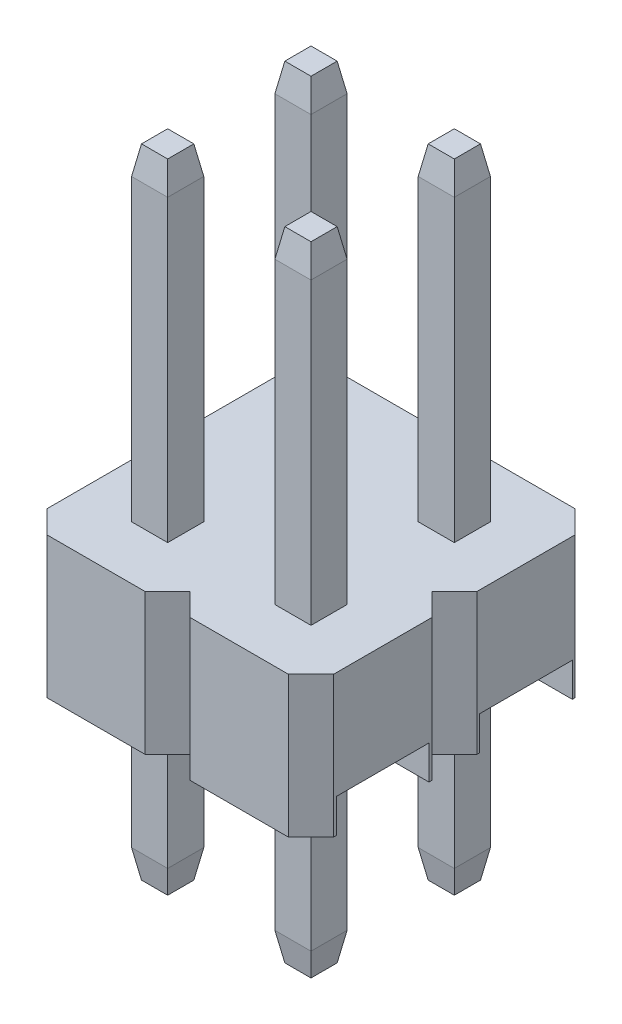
ISO-10303-21;
HEADER;
FILE_DESCRIPTION(('STEP AP214'),'2;1');
FILE_NAME('part.step','',(''),(''),'','','');
FILE_SCHEMA(('AUTOMOTIVE_DESIGN { 1 0 10303 214 1 1 1 1 }'));
ENDSEC;
DATA;
#1=APPLICATION_CONTEXT('core data for automotive mechanical design processes');
#2=APPLICATION_PROTOCOL_DEFINITION('international standard','automotive_design',2000,#1);
#3=PRODUCT_CONTEXT('',#1,'mechanical');
#4=PRODUCT('Part','Part','',(#3));
#5=PRODUCT_RELATED_PRODUCT_CATEGORY('part','',(#4));
#6=PRODUCT_DEFINITION_FORMATION('','',#4);
#7=PRODUCT_DEFINITION_CONTEXT('part definition',#1,'design');
#8=PRODUCT_DEFINITION('design','',#6,#7);
#9=PRODUCT_DEFINITION_SHAPE('','',#8);
#10=(LENGTH_UNIT() NAMED_UNIT(*) SI_UNIT(.MILLI.,.METRE.));
#11=(NAMED_UNIT(*) PLANE_ANGLE_UNIT() SI_UNIT($,.RADIAN.));
#12=(NAMED_UNIT(*) SI_UNIT($,.STERADIAN.) SOLID_ANGLE_UNIT());
#13=UNCERTAINTY_MEASURE_WITH_UNIT(LENGTH_MEASURE(1.E-05),#10,'distance_accuracy_value','');
#14=(GEOMETRIC_REPRESENTATION_CONTEXT(3) GLOBAL_UNCERTAINTY_ASSIGNED_CONTEXT((#13)) GLOBAL_UNIT_ASSIGNED_CONTEXT((#10,
#11,#12)) REPRESENTATION_CONTEXT('',''));
#15=CARTESIAN_POINT('',(0.,0.,0.));
#16=DIRECTION('',(0.,0.,1.));
#17=DIRECTION('',(1.,0.,0.));
#18=AXIS2_PLACEMENT_3D('',#15,#16,#17);
#19=CARTESIAN_POINT('',(-1.27,0.,-1.27));
#20=DIRECTION('',(0.,-1.,0.));
#21=DIRECTION('',(0.,0.,-1.));
#22=AXIS2_PLACEMENT_3D('',#19,#20,#21);
#23=PLANE('',#22);
#24=DIRECTION('',(-0.707106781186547,0.,0.707106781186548));
#25=VECTOR('',#24,1.);
#26=CARTESIAN_POINT('',(2.54,0.,-0.4));
#27=LINE('',#26,#25);
#28=CARTESIAN_POINT('',(2.54,0.,-0.4));
#29=VERTEX_POINT('',#28);
#30=CARTESIAN_POINT('',(2.14,0.,0.));
#31=VERTEX_POINT('',#30);
#32=EDGE_CURVE('P0_E585',#29,#31,#27,.T.);
#33=ORIENTED_EDGE('',*,*,#32,.T.);
#34=DIRECTION('',(0.707106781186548,0.,0.707106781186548));
#35=VECTOR('',#34,1.);
#36=CARTESIAN_POINT('',(2.14,0.,0.));
#37=LINE('',#36,#35);
#38=CARTESIAN_POINT('',(2.54,0.,0.4));
#39=VERTEX_POINT('',#38);
#40=EDGE_CURVE('P0_E544',#31,#39,#37,.T.);
#41=ORIENTED_EDGE('',*,*,#40,.T.);
#42=DIRECTION('',(0.,0.,1.));
#43=VECTOR('',#42,1.);
#44=CARTESIAN_POINT('',(2.54,0.,-1.27));
#45=LINE('',#44,#43);
#46=CARTESIAN_POINT('',(2.54,0.,0.45));
#47=VERTEX_POINT('',#46);
#48=EDGE_CURVE('P0_E498',#39,#47,#45,.T.);
#49=ORIENTED_EDGE('',*,*,#48,.T.);
#50=DIRECTION('',(1.,0.,0.));
#51=VECTOR('',#50,1.);
#52=CARTESIAN_POINT('',(-2.54,0.,0.45));
#53=LINE('',#52,#51);
#54=CARTESIAN_POINT('',(-2.54,0.,0.45));
#55=VERTEX_POINT('',#54);
#56=EDGE_CURVE('P0_E28',#55,#47,#53,.T.);
#57=ORIENTED_EDGE('',*,*,#56,.F.);
#58=DIRECTION('',(0.,0.,-1.));
#59=VECTOR('',#58,1.);
#60=CARTESIAN_POINT('',(-2.54,0.,-1.27));
#61=LINE('',#60,#59);
#62=CARTESIAN_POINT('',(-2.54,0.,0.4));
#63=VERTEX_POINT('',#62);
#64=EDGE_CURVE('P0_E575',#55,#63,#61,.T.);
#65=ORIENTED_EDGE('',*,*,#64,.T.);
#66=DIRECTION('',(0.707106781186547,0.,-0.707106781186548));
#67=VECTOR('',#66,1.);
#68=CARTESIAN_POINT('',(-2.54,0.,0.4));
#69=LINE('',#68,#67);
#70=CARTESIAN_POINT('',(-2.14,0.,0.));
#71=VERTEX_POINT('',#70);
#72=EDGE_CURVE('P0_E548',#63,#71,#69,.T.);
#73=ORIENTED_EDGE('',*,*,#72,.T.);
#74=DIRECTION('',(-0.707106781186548,0.,-0.707106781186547));
#75=VECTOR('',#74,1.);
#76=CARTESIAN_POINT('',(-2.14,0.,0.));
#77=LINE('',#76,#75);
#78=CARTESIAN_POINT('',(-2.54,0.,-0.4));
#79=VERTEX_POINT('',#78);
#80=EDGE_CURVE('P0_E547',#71,#79,#77,.T.);
#81=ORIENTED_EDGE('',*,*,#80,.T.);
#82=DIRECTION('',(0.,0.,-1.));
#83=VECTOR('',#82,1.);
#84=CARTESIAN_POINT('',(-2.54,0.,-1.27));
#85=LINE('',#84,#83);
#86=CARTESIAN_POINT('',(-2.54,0.,-0.45));
#87=VERTEX_POINT('',#86);
#88=EDGE_CURVE('P0_E423',#79,#87,#85,.T.);
#89=ORIENTED_EDGE('',*,*,#88,.T.);
#90=DIRECTION('',(-1.,0.,0.));
#91=VECTOR('',#90,1.);
#92=CARTESIAN_POINT('',(-2.54,0.,-0.45));
#93=LINE('',#92,#91);
#94=CARTESIAN_POINT('',(2.54,0.,-0.45));
#95=VERTEX_POINT('',#94);
#96=EDGE_CURVE('P0_E11',#95,#87,#93,.T.);
#97=ORIENTED_EDGE('',*,*,#96,.F.);
#98=DIRECTION('',(0.,0.,1.));
#99=VECTOR('',#98,1.);
#100=CARTESIAN_POINT('',(2.54,0.,-1.27));
#101=LINE('',#100,#99);
#102=EDGE_CURVE('P0_E530',#95,#29,#101,.T.);
#103=ORIENTED_EDGE('',*,*,#102,.T.);
#104=EDGE_LOOP('',(#33,#41,#49,#57,#65,#73,#81,#89,#97,#103));
#105=FACE_BOUND('',#104,.T.);
#106=ADVANCED_FACE('P0_F17',(#105),#23,.T.);
#107=CARTESIAN_POINT('',(-1.59,2.5,-1.59));
#108=DIRECTION('',(1.,0.,0.));
#109=DIRECTION('',(0.,0.,-1.));
#110=AXIS2_PLACEMENT_3D('',#107,#108,#109);
#111=PLANE('',#110);
#112=DIRECTION('',(0.,-1.,0.));
#113=VECTOR('',#112,1.);
#114=CARTESIAN_POINT('',(-1.59,2.5,-1.59));
#115=LINE('',#114,#113);
#116=CARTESIAN_POINT('',(-1.59,2.5,-1.59));
#117=VERTEX_POINT('',#116);
#118=CARTESIAN_POINT('',(-1.59,0.6,-1.59));
#119=VERTEX_POINT('',#118);
#120=EDGE_CURVE('P0_E489',#117,#119,#115,.T.);
#121=ORIENTED_EDGE('',*,*,#120,.F.);
#122=DIRECTION('',(0.,0.,1.));
#123=VECTOR('',#122,1.);
#124=CARTESIAN_POINT('',(-1.59,2.5,-1.59));
#125=LINE('',#124,#123);
#126=CARTESIAN_POINT('',(-1.59,2.5,-0.95));
#127=VERTEX_POINT('',#126);
#128=EDGE_CURVE('P0_E391',#117,#127,#125,.T.);
#129=ORIENTED_EDGE('',*,*,#128,.T.);
#130=DIRECTION('',(0.,1.,0.));
#131=VECTOR('',#130,1.);
#132=CARTESIAN_POINT('',(-1.59,2.5,-0.95));
#133=LINE('',#132,#131);
#134=CARTESIAN_POINT('',(-1.59,0.6,-0.95));
#135=VERTEX_POINT('',#134);
#136=EDGE_CURVE('P0_E625',#135,#127,#133,.T.);
#137=ORIENTED_EDGE('',*,*,#136,.F.);
#138=DIRECTION('',(0.,0.,-1.));
#139=VECTOR('',#138,1.);
#140=CARTESIAN_POINT('',(-1.59,0.6,-1.59));
#141=LINE('',#140,#139);
#142=EDGE_CURVE('P0_E539',#135,#119,#141,.T.);
#143=ORIENTED_EDGE('',*,*,#142,.T.);
#144=EDGE_LOOP('',(#121,#129,#137,#143));
#145=FACE_BOUND('',#144,.T.);
#146=ADVANCED_FACE('P0_F1037',(#145),#111,.T.);
#147=CARTESIAN_POINT('',(-2.54,0.6,-2.09));
#148=DIRECTION('',(0.,0.,1.));
#149=DIRECTION('',(1.,0.,0.));
#150=AXIS2_PLACEMENT_3D('',#147,#148,#149);
#151=PLANE('',#150);
#152=DIRECTION('',(1.,0.,0.));
#153=VECTOR('',#152,1.);
#154=CARTESIAN_POINT('',(-1.27,0.6,-2.09));
#155=LINE('',#154,#153);
#156=CARTESIAN_POINT('',(-2.54,0.6,-2.09));
#157=VERTEX_POINT('',#156);
#158=CARTESIAN_POINT('',(2.54,0.6,-2.09));
#159=VERTEX_POINT('',#158);
#160=EDGE_CURVE('P0_E438',#157,#159,#155,.T.);
#161=ORIENTED_EDGE('',*,*,#160,.F.);
#162=DIRECTION('',(0.,-1.,0.));
#163=VECTOR('',#162,1.);
#164=CARTESIAN_POINT('',(-2.54,0.6,-2.09));
#165=LINE('',#164,#163);
#166=CARTESIAN_POINT('',(-2.54,0.,-2.09));
#167=VERTEX_POINT('',#166);
#168=EDGE_CURVE('P0_E473',#157,#167,#165,.T.);
#169=ORIENTED_EDGE('',*,*,#168,.T.);
#170=DIRECTION('',(-1.,0.,0.));
#171=VECTOR('',#170,1.);
#172=CARTESIAN_POINT('',(-1.27,0.,-2.09));
#173=LINE('',#172,#171);
#174=CARTESIAN_POINT('',(2.54,0.,-2.09));
#175=VERTEX_POINT('',#174);
#176=EDGE_CURVE('P0_E468',#175,#167,#173,.T.);
#177=ORIENTED_EDGE('',*,*,#176,.F.);
#178=DIRECTION('',(0.,1.,0.));
#179=VECTOR('',#178,1.);
#180=CARTESIAN_POINT('',(2.54,0.6,-2.09));
#181=LINE('',#180,#179);
#182=EDGE_CURVE('P0_E21',#175,#159,#181,.T.);
#183=ORIENTED_EDGE('',*,*,#182,.T.);
#184=EDGE_LOOP('',(#161,#169,#177,#183));
#185=FACE_BOUND('',#184,.T.);
#186=ADVANCED_FACE('P0_F1043',(#185),#151,.T.);
#187=CARTESIAN_POINT('',(-2.54,0.6,-0.45));
#188=DIRECTION('',(0.,0.,-1.));
#189=DIRECTION('',(0.,-1.,0.));
#190=AXIS2_PLACEMENT_3D('',#187,#188,#189);
#191=PLANE('',#190);
#192=DIRECTION('',(-1.,0.,0.));
#193=VECTOR('',#192,1.);
#194=CARTESIAN_POINT('',(-1.27,0.6,-0.45));
#195=LINE('',#194,#193);
#196=CARTESIAN_POINT('',(2.54,0.6,-0.45));
#197=VERTEX_POINT('',#196);
#198=CARTESIAN_POINT('',(-2.54,0.6,-0.45));
#199=VERTEX_POINT('',#198);
#200=EDGE_CURVE('P0_E435',#197,#199,#195,.T.);
#201=ORIENTED_EDGE('',*,*,#200,.F.);
#202=DIRECTION('',(0.,-1.,0.));
#203=VECTOR('',#202,1.);
#204=CARTESIAN_POINT('',(2.54,0.6,-0.45));
#205=LINE('',#204,#203);
#206=EDGE_CURVE('P0_E390',#197,#95,#205,.T.);
#207=ORIENTED_EDGE('',*,*,#206,.T.);
#208=ORIENTED_EDGE('',*,*,#96,.T.);
#209=DIRECTION('',(0.,1.,0.));
#210=VECTOR('',#209,1.);
#211=CARTESIAN_POINT('',(-2.54,0.6,-0.45));
#212=LINE('',#211,#210);
#213=EDGE_CURVE('P0_E634',#87,#199,#212,.T.);
#214=ORIENTED_EDGE('',*,*,#213,.T.);
#215=EDGE_LOOP('',(#201,#207,#208,#214));
#216=FACE_BOUND('',#215,.T.);
#217=ADVANCED_FACE('P0_F1050',(#216),#191,.T.);
#218=CARTESIAN_POINT('',(0.95,2.5,-1.59));
#219=DIRECTION('',(1.,0.,0.));
#220=DIRECTION('',(0.,0.,-1.));
#221=AXIS2_PLACEMENT_3D('',#218,#219,#220);
#222=PLANE('',#221);
#223=DIRECTION('',(0.,-1.,0.));
#224=VECTOR('',#223,1.);
#225=CARTESIAN_POINT('',(0.95,2.5,-1.59));
#226=LINE('',#225,#224);
#227=CARTESIAN_POINT('',(0.95,2.5,-1.59));
#228=VERTEX_POINT('',#227);
#229=CARTESIAN_POINT('',(0.95,0.6,-1.59));
#230=VERTEX_POINT('',#229);
#231=EDGE_CURVE('P0_E622',#228,#230,#226,.T.);
#232=ORIENTED_EDGE('',*,*,#231,.F.);
#233=DIRECTION('',(0.,0.,1.));
#234=VECTOR('',#233,1.);
#235=CARTESIAN_POINT('',(0.95,2.5,-1.59));
#236=LINE('',#235,#234);
#237=CARTESIAN_POINT('',(0.95,2.5,-0.95));
#238=VERTEX_POINT('',#237);
#239=EDGE_CURVE('P0_E445',#228,#238,#236,.T.);
#240=ORIENTED_EDGE('',*,*,#239,.T.);
#241=DIRECTION('',(0.,1.,0.));
#242=VECTOR('',#241,1.);
#243=CARTESIAN_POINT('',(0.95,2.5,-0.95));
#244=LINE('',#243,#242);
#245=CARTESIAN_POINT('',(0.95,0.6,-0.95));
#246=VERTEX_POINT('',#245);
#247=EDGE_CURVE('P0_E651',#246,#238,#244,.T.);
#248=ORIENTED_EDGE('',*,*,#247,.F.);
#249=DIRECTION('',(0.,0.,1.));
#250=VECTOR('',#249,1.);
#251=CARTESIAN_POINT('',(0.95,0.6,-1.27));
#252=LINE('',#251,#250);
#253=EDGE_CURVE('P0_E626',#230,#246,#252,.T.);
#254=ORIENTED_EDGE('',*,*,#253,.F.);
#255=EDGE_LOOP('',(#232,#240,#248,#254));
#256=FACE_BOUND('',#255,.T.);
#257=ADVANCED_FACE('P0_F1099',(#256),#222,.T.);
#258=CARTESIAN_POINT('',(-1.59,2.5,0.95));
#259=DIRECTION('',(1.,0.,0.));
#260=DIRECTION('',(0.,0.,-1.));
#261=AXIS2_PLACEMENT_3D('',#258,#259,#260);
#262=PLANE('',#261);
#263=DIRECTION('',(0.,-1.,0.));
#264=VECTOR('',#263,1.);
#265=CARTESIAN_POINT('',(-1.59,2.5,0.95));
#266=LINE('',#265,#264);
#267=CARTESIAN_POINT('',(-1.59,2.5,0.95));
#268=VERTEX_POINT('',#267);
#269=CARTESIAN_POINT('',(-1.59,0.6,0.95));
#270=VERTEX_POINT('',#269);
#271=EDGE_CURVE('P0_E648',#268,#270,#266,.T.);
#272=ORIENTED_EDGE('',*,*,#271,.F.);
#273=DIRECTION('',(0.,0.,1.));
#274=VECTOR('',#273,1.);
#275=CARTESIAN_POINT('',(-1.59,2.5,0.95));
#276=LINE('',#275,#274);
#277=CARTESIAN_POINT('',(-1.59,2.5,1.59));
#278=VERTEX_POINT('',#277);
#279=EDGE_CURVE('P0_E446',#268,#278,#276,.T.);
#280=ORIENTED_EDGE('',*,*,#279,.T.);
#281=DIRECTION('',(0.,1.,0.));
#282=VECTOR('',#281,1.);
#283=CARTESIAN_POINT('',(-1.59,2.5,1.59));
#284=LINE('',#283,#282);
#285=CARTESIAN_POINT('',(-1.59,0.6,1.59));
#286=VERTEX_POINT('',#285);
#287=EDGE_CURVE('P0_E458',#286,#278,#284,.T.);
#288=ORIENTED_EDGE('',*,*,#287,.F.);
#289=DIRECTION('',(0.,0.,-1.));
#290=VECTOR('',#289,1.);
#291=CARTESIAN_POINT('',(-1.59,0.6,0.95));
#292=LINE('',#291,#290);
#293=EDGE_CURVE('P0_E563',#286,#270,#292,.T.);
#294=ORIENTED_EDGE('',*,*,#293,.T.);
#295=EDGE_LOOP('',(#272,#280,#288,#294));
#296=FACE_BOUND('',#295,.T.);
#297=ADVANCED_FACE('P0_F1010',(#296),#262,.T.);
#298=CARTESIAN_POINT('',(-2.54,0.6,0.45));
#299=DIRECTION('',(0.,0.,1.));
#300=DIRECTION('',(1.,0.,0.));
#301=AXIS2_PLACEMENT_3D('',#298,#299,#300);
#302=PLANE('',#301);
#303=DIRECTION('',(1.,0.,0.));
#304=VECTOR('',#303,1.);
#305=CARTESIAN_POINT('',(-1.27,0.6,0.45));
#306=LINE('',#305,#304);
#307=CARTESIAN_POINT('',(-2.54,0.6,0.45));
#308=VERTEX_POINT('',#307);
#309=CARTESIAN_POINT('',(2.54,0.6,0.45));
#310=VERTEX_POINT('',#309);
#311=EDGE_CURVE('P0_E333',#308,#310,#306,.T.);
#312=ORIENTED_EDGE('',*,*,#311,.F.);
#313=DIRECTION('',(0.,-1.,0.));
#314=VECTOR('',#313,1.);
#315=CARTESIAN_POINT('',(-2.54,0.6,0.45));
#316=LINE('',#315,#314);
#317=EDGE_CURVE('P0_E579',#308,#55,#316,.T.);
#318=ORIENTED_EDGE('',*,*,#317,.T.);
#319=ORIENTED_EDGE('',*,*,#56,.T.);
#320=DIRECTION('',(0.,1.,0.));
#321=VECTOR('',#320,1.);
#322=CARTESIAN_POINT('',(2.54,0.6,0.45));
#323=LINE('',#322,#321);
#324=EDGE_CURVE('P0_E351',#47,#310,#323,.T.);
#325=ORIENTED_EDGE('',*,*,#324,.T.);
#326=EDGE_LOOP('',(#312,#318,#319,#325));
#327=FACE_BOUND('',#326,.T.);
#328=ADVANCED_FACE('P0_F352',(#327),#302,.T.);
#329=CARTESIAN_POINT('',(-2.54,0.6,2.09));
#330=DIRECTION('',(0.,0.,-1.));
#331=DIRECTION('',(0.,-1.,0.));
#332=AXIS2_PLACEMENT_3D('',#329,#330,#331);
#333=PLANE('',#332);
#334=DIRECTION('',(-1.,0.,0.));
#335=VECTOR('',#334,1.);
#336=CARTESIAN_POINT('',(-1.27,0.6,2.09));
#337=LINE('',#336,#335);
#338=CARTESIAN_POINT('',(2.54,0.6,2.09));
#339=VERTEX_POINT('',#338);
#340=CARTESIAN_POINT('',(-2.54,0.6,2.09));
#341=VERTEX_POINT('',#340);
#342=EDGE_CURVE('P0_E348',#339,#341,#337,.T.);
#343=ORIENTED_EDGE('',*,*,#342,.F.);
#344=DIRECTION('',(0.,-1.,0.));
#345=VECTOR('',#344,1.);
#346=CARTESIAN_POINT('',(2.54,0.6,2.09));
#347=LINE('',#346,#345);
#348=CARTESIAN_POINT('',(2.54,0.,2.09));
#349=VERTEX_POINT('',#348);
#350=EDGE_CURVE('P0_E362',#339,#349,#347,.T.);
#351=ORIENTED_EDGE('',*,*,#350,.T.);
#352=DIRECTION('',(1.,0.,0.));
#353=VECTOR('',#352,1.);
#354=CARTESIAN_POINT('',(-1.27,0.,2.09));
#355=LINE('',#354,#353);
#356=CARTESIAN_POINT('',(-2.54,0.,2.09));
#357=VERTEX_POINT('',#356);
#358=EDGE_CURVE('P0_E551',#357,#349,#355,.T.);
#359=ORIENTED_EDGE('',*,*,#358,.F.);
#360=DIRECTION('',(0.,1.,0.));
#361=VECTOR('',#360,1.);
#362=CARTESIAN_POINT('',(-2.54,0.6,2.09));
#363=LINE('',#362,#361);
#364=EDGE_CURVE('P0_E408',#357,#341,#363,.T.);
#365=ORIENTED_EDGE('',*,*,#364,.T.);
#366=EDGE_LOOP('',(#343,#351,#359,#365));
#367=FACE_BOUND('',#366,.T.);
#368=ADVANCED_FACE('P0_F1055',(#367),#333,.T.);
#369=CARTESIAN_POINT('',(0.95,2.5,0.95));
#370=DIRECTION('',(1.,0.,0.));
#371=DIRECTION('',(0.,0.,-1.));
#372=AXIS2_PLACEMENT_3D('',#369,#370,#371);
#373=PLANE('',#372);
#374=DIRECTION('',(0.,-1.,0.));
#375=VECTOR('',#374,1.);
#376=CARTESIAN_POINT('',(0.95,2.5,0.95));
#377=LINE('',#376,#375);
#378=CARTESIAN_POINT('',(0.95,2.5,0.95));
#379=VERTEX_POINT('',#378);
#380=CARTESIAN_POINT('',(0.95,0.6,0.95));
#381=VERTEX_POINT('',#380);
#382=EDGE_CURVE('P0_E455',#379,#381,#377,.T.);
#383=ORIENTED_EDGE('',*,*,#382,.F.);
#384=DIRECTION('',(0.,0.,1.));
#385=VECTOR('',#384,1.);
#386=CARTESIAN_POINT('',(0.95,2.5,0.95));
#387=LINE('',#386,#385);
#388=CARTESIAN_POINT('',(0.95,2.5,1.59));
#389=VERTEX_POINT('',#388);
#390=EDGE_CURVE('P0_E375',#379,#389,#387,.T.);
#391=ORIENTED_EDGE('',*,*,#390,.T.);
#392=DIRECTION('',(0.,1.,0.));
#393=VECTOR('',#392,1.);
#394=CARTESIAN_POINT('',(0.95,2.5,1.59));
#395=LINE('',#394,#393);
#396=CARTESIAN_POINT('',(0.95,0.6,1.59));
#397=VERTEX_POINT('',#396);
#398=EDGE_CURVE('P0_E428',#397,#389,#395,.T.);
#399=ORIENTED_EDGE('',*,*,#398,.F.);
#400=DIRECTION('',(0.,0.,1.));
#401=VECTOR('',#400,1.);
#402=CARTESIAN_POINT('',(0.95,0.6,1.27));
#403=LINE('',#402,#401);
#404=EDGE_CURVE('P0_E459',#381,#397,#403,.T.);
#405=ORIENTED_EDGE('',*,*,#404,.F.);
#406=EDGE_LOOP('',(#383,#391,#399,#405));
#407=FACE_BOUND('',#406,.T.);
#408=ADVANCED_FACE('P0_F1052',(#407),#373,.T.);
#409=CARTESIAN_POINT('',(-2.54,2.5,-0.4));
#410=DIRECTION('',(0.707106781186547,0.,-0.707106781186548));
#411=DIRECTION('',(0.,-1.,0.));
#412=AXIS2_PLACEMENT_3D('',#409,#410,#411);
#413=PLANE('',#412);
#414=DIRECTION('',(0.,1.,0.));
#415=VECTOR('',#414,1.);
#416=CARTESIAN_POINT('',(-2.14,2.5,0.));
#417=LINE('',#416,#415);
#418=CARTESIAN_POINT('',(-2.14,2.5,0.));
#419=VERTEX_POINT('',#418);
#420=EDGE_CURVE('P0_E488',#71,#419,#417,.T.);
#421=ORIENTED_EDGE('',*,*,#420,.T.);
#422=DIRECTION('',(0.707106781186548,0.,0.707106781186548));
#423=VECTOR('',#422,1.);
#424=CARTESIAN_POINT('',(-2.54,2.5,-0.4));
#425=LINE('',#424,#423);
#426=CARTESIAN_POINT('',(-2.54,2.5,-0.4));
#427=VERTEX_POINT('',#426);
#428=EDGE_CURVE('P0_E413',#427,#419,#425,.T.);
#429=ORIENTED_EDGE('',*,*,#428,.F.);
#430=DIRECTION('',(0.,-1.,0.));
#431=VECTOR('',#430,1.);
#432=CARTESIAN_POINT('',(-2.54,2.5,-0.4));
#433=LINE('',#432,#431);
#434=EDGE_CURVE('P0_E418',#427,#79,#433,.T.);
#435=ORIENTED_EDGE('',*,*,#434,.T.);
#436=ORIENTED_EDGE('',*,*,#80,.F.);
#437=EDGE_LOOP('',(#421,#429,#435,#436));
#438=FACE_BOUND('',#437,.T.);
#439=ADVANCED_FACE('P0_F897',(#438),#413,.F.);
#440=CARTESIAN_POINT('',(-0.4,2.5,-2.54));
#441=DIRECTION('',(-0.707106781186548,0.,0.707106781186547));
#442=DIRECTION('',(0.,1.,0.));
#443=AXIS2_PLACEMENT_3D('',#440,#441,#442);
#444=PLANE('',#443);
#445=DIRECTION('',(0.,1.,0.));
#446=VECTOR('',#445,1.);
#447=CARTESIAN_POINT('',(-0.4,2.5,-2.54));
#448=LINE('',#447,#446);
#449=CARTESIAN_POINT('',(-0.4,0.,-2.54));
#450=VERTEX_POINT('',#449);
#451=CARTESIAN_POINT('',(-0.4,2.5,-2.54));
#452=VERTEX_POINT('',#451);
#453=EDGE_CURVE('P0_E711',#450,#452,#448,.T.);
#454=ORIENTED_EDGE('',*,*,#453,.T.);
#455=DIRECTION('',(-0.707106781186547,0.,-0.707106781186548));
#456=VECTOR('',#455,1.);
#457=CARTESIAN_POINT('',(-0.4,2.5,-2.54));
#458=LINE('',#457,#456);
#459=CARTESIAN_POINT('',(0.,2.5,-2.14));
#460=VERTEX_POINT('',#459);
#461=EDGE_CURVE('P0_E722',#460,#452,#458,.T.);
#462=ORIENTED_EDGE('',*,*,#461,.F.);
#463=DIRECTION('',(0.,-1.,0.));
#464=VECTOR('',#463,1.);
#465=CARTESIAN_POINT('',(0.,2.5,-2.14));
#466=LINE('',#465,#464);
#467=CARTESIAN_POINT('',(0.,0.,-2.14));
#468=VERTEX_POINT('',#467);
#469=EDGE_CURVE('P0_E42',#460,#468,#466,.T.);
#470=ORIENTED_EDGE('',*,*,#469,.T.);
#471=DIRECTION('',(0.707106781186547,0.,0.707106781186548));
#472=VECTOR('',#471,1.);
#473=CARTESIAN_POINT('',(-0.4,0.,-2.54));
#474=LINE('',#473,#472);
#475=EDGE_CURVE('P0_E467',#450,#468,#474,.T.);
#476=ORIENTED_EDGE('',*,*,#475,.F.);
#477=EDGE_LOOP('',(#454,#462,#470,#476));
#478=FACE_BOUND('',#477,.T.);
#479=ADVANCED_FACE('P0_F969',(#478),#444,.F.);
#480=CARTESIAN_POINT('',(-2.54,2.5,-2.14));
#481=DIRECTION('',(0.707106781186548,0.,0.707106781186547));
#482=DIRECTION('',(0.,-1.,0.));
#483=AXIS2_PLACEMENT_3D('',#480,#481,#482);
#484=PLANE('',#483);
#485=DIRECTION('',(0.,1.,0.));
#486=VECTOR('',#485,1.);
#487=CARTESIAN_POINT('',(-2.54,2.5,-2.14));
#488=LINE('',#487,#486);
#489=CARTESIAN_POINT('',(-2.54,0.,-2.14));
#490=VERTEX_POINT('',#489);
#491=CARTESIAN_POINT('',(-2.54,2.5,-2.14));
#492=VERTEX_POINT('',#491);
#493=EDGE_CURVE('P0_E422',#490,#492,#488,.T.);
#494=ORIENTED_EDGE('',*,*,#493,.T.);
#495=DIRECTION('',(-0.707106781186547,0.,0.707106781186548));
#496=VECTOR('',#495,1.);
#497=CARTESIAN_POINT('',(-2.54,2.5,-2.14));
#498=LINE('',#497,#496);
#499=CARTESIAN_POINT('',(-2.14,2.5,-2.54));
#500=VERTEX_POINT('',#499);
#501=EDGE_CURVE('P0_E509',#500,#492,#498,.T.);
#502=ORIENTED_EDGE('',*,*,#501,.F.);
#503=DIRECTION('',(0.,-1.,0.));
#504=VECTOR('',#503,1.);
#505=CARTESIAN_POINT('',(-2.14,2.5,-2.54));
#506=LINE('',#505,#504);
#507=CARTESIAN_POINT('',(-2.14,0.,-2.54));
#508=VERTEX_POINT('',#507);
#509=EDGE_CURVE('P0_E433',#500,#508,#506,.T.);
#510=ORIENTED_EDGE('',*,*,#509,.T.);
#511=DIRECTION('',(0.707106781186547,0.,-0.707106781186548));
#512=VECTOR('',#511,1.);
#513=CARTESIAN_POINT('',(-2.54,0.,-2.14));
#514=LINE('',#513,#512);
#515=EDGE_CURVE('P0_E464',#490,#508,#514,.T.);
#516=ORIENTED_EDGE('',*,*,#515,.F.);
#517=EDGE_LOOP('',(#494,#502,#510,#516));
#518=FACE_BOUND('',#517,.T.);
#519=ADVANCED_FACE('P0_F884',(#518),#484,.F.);
#520=CARTESIAN_POINT('',(0.,2.5,-2.14));
#521=DIRECTION('',(0.707106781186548,0.,0.707106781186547));
#522=DIRECTION('',(0.,-1.,0.));
#523=AXIS2_PLACEMENT_3D('',#520,#521,#522);
#524=PLANE('',#523);
#525=ORIENTED_EDGE('',*,*,#469,.F.);
#526=DIRECTION('',(-0.707106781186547,0.,0.707106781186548));
#527=VECTOR('',#526,1.);
#528=CARTESIAN_POINT('',(0.,2.5,-2.14));
#529=LINE('',#528,#527);
#530=CARTESIAN_POINT('',(0.4,2.5,-2.54));
#531=VERTEX_POINT('',#530);
#532=EDGE_CURVE('P0_E718',#531,#460,#529,.T.);
#533=ORIENTED_EDGE('',*,*,#532,.F.);
#534=DIRECTION('',(0.,-1.,0.));
#535=VECTOR('',#534,1.);
#536=CARTESIAN_POINT('',(0.4,2.5,-2.54));
#537=LINE('',#536,#535);
#538=CARTESIAN_POINT('',(0.4,0.,-2.54));
#539=VERTEX_POINT('',#538);
#540=EDGE_CURVE('P0_E454',#531,#539,#537,.T.);
#541=ORIENTED_EDGE('',*,*,#540,.T.);
#542=DIRECTION('',(0.707106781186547,0.,-0.707106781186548));
#543=VECTOR('',#542,1.);
#544=CARTESIAN_POINT('',(0.,0.,-2.14));
#545=LINE('',#544,#543);
#546=EDGE_CURVE('P0_E559',#468,#539,#545,.T.);
#547=ORIENTED_EDGE('',*,*,#546,.F.);
#548=EDGE_LOOP('',(#525,#533,#541,#547));
#549=FACE_BOUND('',#548,.T.);
#550=ADVANCED_FACE('P0_F968',(#549),#524,.F.);
#551=CARTESIAN_POINT('',(-1.27,0.,-1.27));
#552=DIRECTION('',(0.,-1.,0.));
#553=DIRECTION('',(0.,0.,-1.));
#554=AXIS2_PLACEMENT_3D('',#551,#552,#553);
#555=PLANE('',#554);
#556=DIRECTION('',(1.,0.,0.));
#557=VECTOR('',#556,1.);
#558=CARTESIAN_POINT('',(0.4,0.,-2.54));
#559=LINE('',#558,#557);
#560=CARTESIAN_POINT('',(2.14,0.,-2.54));
#561=VERTEX_POINT('',#560);
#562=EDGE_CURVE('P0_E429',#539,#561,#559,.T.);
#563=ORIENTED_EDGE('',*,*,#562,.T.);
#564=DIRECTION('',(0.707106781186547,0.,0.707106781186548));
#565=VECTOR('',#564,1.);
#566=CARTESIAN_POINT('',(2.14,0.,-2.54));
#567=LINE('',#566,#565);
#568=CARTESIAN_POINT('',(2.54,0.,-2.14));
#569=VERTEX_POINT('',#568);
#570=EDGE_CURVE('P0_E588',#561,#569,#567,.T.);
#571=ORIENTED_EDGE('',*,*,#570,.T.);
#572=DIRECTION('',(0.,0.,1.));
#573=VECTOR('',#572,1.);
#574=CARTESIAN_POINT('',(2.54,0.,-1.27));
#575=LINE('',#574,#573);
#576=EDGE_CURVE('P0_E357',#569,#175,#575,.T.);
#577=ORIENTED_EDGE('',*,*,#576,.T.);
#578=ORIENTED_EDGE('',*,*,#176,.T.);
#579=DIRECTION('',(0.,0.,-1.));
#580=VECTOR('',#579,1.);
#581=CARTESIAN_POINT('',(-2.54,0.,-2.14));
#582=LINE('',#581,#580);
#583=EDGE_CURVE('P0_E469',#167,#490,#582,.T.);
#584=ORIENTED_EDGE('',*,*,#583,.T.);
#585=ORIENTED_EDGE('',*,*,#515,.T.);
#586=DIRECTION('',(1.,0.,0.));
#587=VECTOR('',#586,1.);
#588=CARTESIAN_POINT('',(-2.14,0.,-2.54));
#589=LINE('',#588,#587);
#590=EDGE_CURVE('P0_E823',#508,#450,#589,.T.);
#591=ORIENTED_EDGE('',*,*,#590,.T.);
#592=ORIENTED_EDGE('',*,*,#475,.T.);
#593=ORIENTED_EDGE('',*,*,#546,.T.);
#594=EDGE_LOOP('',(#563,#571,#577,#578,#584,#585,#591,#592,#593));
#595=FACE_BOUND('',#594,.T.);
#596=ADVANCED_FACE('P0_F975',(#595),#555,.T.);
#597=CARTESIAN_POINT('',(2.54,2.5,-0.4));
#598=DIRECTION('',(-0.707106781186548,0.,-0.707106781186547));
#599=DIRECTION('',(-0.707106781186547,0.,0.707106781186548));
#600=AXIS2_PLACEMENT_3D('',#597,#598,#599);
#601=PLANE('',#600);
#602=DIRECTION('',(0.,1.,0.));
#603=VECTOR('',#602,1.);
#604=CARTESIAN_POINT('',(2.54,2.5,-0.4));
#605=LINE('',#604,#603);
#606=CARTESIAN_POINT('',(2.54,2.5,-0.4));
#607=VERTEX_POINT('',#606);
#608=EDGE_CURVE('P0_E534',#29,#607,#605,.T.);
#609=ORIENTED_EDGE('',*,*,#608,.T.);
#610=DIRECTION('',(0.707106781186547,0.,-0.707106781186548));
#611=VECTOR('',#610,1.);
#612=CARTESIAN_POINT('',(2.54,2.5,-0.4));
#613=LINE('',#612,#611);
#614=CARTESIAN_POINT('',(2.14,2.5,0.));
#615=VERTEX_POINT('',#614);
#616=EDGE_CURVE('P0_E514',#615,#607,#613,.T.);
#617=ORIENTED_EDGE('',*,*,#616,.F.);
#618=DIRECTION('',(0.,-1.,0.));
#619=VECTOR('',#618,1.);
#620=CARTESIAN_POINT('',(2.14,2.5,0.));
#621=LINE('',#620,#619);
#622=EDGE_CURVE('P0_E399',#615,#31,#621,.T.);
#623=ORIENTED_EDGE('',*,*,#622,.T.);
#624=ORIENTED_EDGE('',*,*,#32,.F.);
#625=EDGE_LOOP('',(#609,#617,#623,#624));
#626=FACE_BOUND('',#625,.T.);
#627=ADVANCED_FACE('P0_F950',(#626),#601,.F.);
#628=CARTESIAN_POINT('',(2.14,2.5,-2.54));
#629=DIRECTION('',(-0.707106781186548,0.,0.707106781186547));
#630=DIRECTION('',(0.,1.,0.));
#631=AXIS2_PLACEMENT_3D('',#628,#629,#630);
#632=PLANE('',#631);
#633=DIRECTION('',(0.,1.,0.));
#634=VECTOR('',#633,1.);
#635=CARTESIAN_POINT('',(2.14,2.5,-2.54));
#636=LINE('',#635,#634);
#637=CARTESIAN_POINT('',(2.14,2.5,-2.54));
#638=VERTEX_POINT('',#637);
#639=EDGE_CURVE('P0_E434',#561,#638,#636,.T.);
#640=ORIENTED_EDGE('',*,*,#639,.T.);
#641=DIRECTION('',(-0.707106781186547,0.,-0.707106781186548));
#642=VECTOR('',#641,1.);
#643=CARTESIAN_POINT('',(2.14,2.5,-2.54));
#644=LINE('',#643,#642);
#645=CARTESIAN_POINT('',(2.54,2.5,-2.14));
#646=VERTEX_POINT('',#645);
#647=EDGE_CURVE('P0_E700',#646,#638,#644,.T.);
#648=ORIENTED_EDGE('',*,*,#647,.F.);
#649=DIRECTION('',(0.,-1.,0.));
#650=VECTOR('',#649,1.);
#651=CARTESIAN_POINT('',(2.54,2.5,-2.14));
#652=LINE('',#651,#650);
#653=EDGE_CURVE('P0_E407',#646,#569,#652,.T.);
#654=ORIENTED_EDGE('',*,*,#653,.T.);
#655=ORIENTED_EDGE('',*,*,#570,.F.);
#656=EDGE_LOOP('',(#640,#648,#654,#655));
#657=FACE_BOUND('',#656,.T.);
#658=ADVANCED_FACE('P0_F961',(#657),#632,.F.);
#659=CARTESIAN_POINT('',(2.14,2.5,0.));
#660=DIRECTION('',(-0.707106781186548,0.,0.707106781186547));
#661=DIRECTION('',(0.,1.,0.));
#662=AXIS2_PLACEMENT_3D('',#659,#660,#661);
#663=PLANE('',#662);
#664=ORIENTED_EDGE('',*,*,#622,.F.);
#665=DIRECTION('',(-0.707106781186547,0.,-0.707106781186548));
#666=VECTOR('',#665,1.);
#667=CARTESIAN_POINT('',(2.14,2.5,0.));
#668=LINE('',#667,#666);
#669=CARTESIAN_POINT('',(2.54,2.5,0.4));
#670=VERTEX_POINT('',#669);
#671=EDGE_CURVE('P0_E510',#670,#615,#668,.T.);
#672=ORIENTED_EDGE('',*,*,#671,.F.);
#673=DIRECTION('',(0.,-1.,0.));
#674=VECTOR('',#673,1.);
#675=CARTESIAN_POINT('',(2.54,2.5,0.4));
#676=LINE('',#675,#674);
#677=EDGE_CURVE('P0_E505',#670,#39,#676,.T.);
#678=ORIENTED_EDGE('',*,*,#677,.T.);
#679=ORIENTED_EDGE('',*,*,#40,.F.);
#680=EDGE_LOOP('',(#664,#672,#678,#679));
#681=FACE_BOUND('',#680,.T.);
#682=ADVANCED_FACE('P0_F945',(#681),#663,.F.);
#683=CARTESIAN_POINT('',(0.,2.5,2.14));
#684=DIRECTION('',(0.707106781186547,0.,-0.707106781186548));
#685=DIRECTION('',(0.,-1.,0.));
#686=AXIS2_PLACEMENT_3D('',#683,#684,#685);
#687=PLANE('',#686);
#688=DIRECTION('',(0.,1.,0.));
#689=VECTOR('',#688,1.);
#690=CARTESIAN_POINT('',(0.4,2.5,2.54));
#691=LINE('',#690,#689);
#692=CARTESIAN_POINT('',(0.4,0.,2.54));
#693=VERTEX_POINT('',#692);
#694=CARTESIAN_POINT('',(0.4,2.5,2.54));
#695=VERTEX_POINT('',#694);
#696=EDGE_CURVE('P0_E499',#693,#695,#691,.T.);
#697=ORIENTED_EDGE('',*,*,#696,.T.);
#698=DIRECTION('',(0.707106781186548,0.,0.707106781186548));
#699=VECTOR('',#698,1.);
#700=CARTESIAN_POINT('',(0.,2.5,2.14));
#701=LINE('',#700,#699);
#702=CARTESIAN_POINT('',(0.,2.5,2.14));
#703=VERTEX_POINT('',#702);
#704=EDGE_CURVE('P0_E478',#703,#695,#701,.T.);
#705=ORIENTED_EDGE('',*,*,#704,.F.);
#706=DIRECTION('',(0.,-1.,0.));
#707=VECTOR('',#706,1.);
#708=CARTESIAN_POINT('',(0.,2.5,2.14));
#709=LINE('',#708,#707);
#710=CARTESIAN_POINT('',(0.,0.,2.14));
#711=VERTEX_POINT('',#710);
#712=EDGE_CURVE('P0_E396',#703,#711,#709,.T.);
#713=ORIENTED_EDGE('',*,*,#712,.T.);
#714=DIRECTION('',(-0.707106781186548,0.,-0.707106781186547));
#715=VECTOR('',#714,1.);
#716=CARTESIAN_POINT('',(0.4,0.,2.54));
#717=LINE('',#716,#715);
#718=EDGE_CURVE('P0_E730',#693,#711,#717,.T.);
#719=ORIENTED_EDGE('',*,*,#718,.F.);
#720=EDGE_LOOP('',(#697,#705,#713,#719));
#721=FACE_BOUND('',#720,.T.);
#722=ADVANCED_FACE('P0_F930',(#721),#687,.F.);
#723=CARTESIAN_POINT('',(2.54,2.5,2.14));
#724=DIRECTION('',(-0.707106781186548,0.,-0.707106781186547));
#725=DIRECTION('',(-0.707106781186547,0.,0.707106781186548));
#726=AXIS2_PLACEMENT_3D('',#723,#724,#725);
#727=PLANE('',#726);
#728=DIRECTION('',(0.,1.,0.));
#729=VECTOR('',#728,1.);
#730=CARTESIAN_POINT('',(2.54,2.5,2.14));
#731=LINE('',#730,#729);
#732=CARTESIAN_POINT('',(2.54,0.,2.14));
#733=VERTEX_POINT('',#732);
#734=CARTESIAN_POINT('',(2.54,2.5,2.14));
#735=VERTEX_POINT('',#734);
#736=EDGE_CURVE('P0_E584',#733,#735,#731,.T.);
#737=ORIENTED_EDGE('',*,*,#736,.T.);
#738=DIRECTION('',(0.707106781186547,0.,-0.707106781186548));
#739=VECTOR('',#738,1.);
#740=CARTESIAN_POINT('',(2.54,2.5,2.14));
#741=LINE('',#740,#739);
#742=CARTESIAN_POINT('',(2.14,2.5,2.54));
#743=VERTEX_POINT('',#742);
#744=EDGE_CURVE('P0_E682',#743,#735,#741,.T.);
#745=ORIENTED_EDGE('',*,*,#744,.F.);
#746=DIRECTION('',(0.,-1.,0.));
#747=VECTOR('',#746,1.);
#748=CARTESIAN_POINT('',(2.14,2.5,2.54));
#749=LINE('',#748,#747);
#750=CARTESIAN_POINT('',(2.14,0.,2.54));
#751=VERTEX_POINT('',#750);
#752=EDGE_CURVE('P0_E661',#743,#751,#749,.T.);
#753=ORIENTED_EDGE('',*,*,#752,.T.);
#754=DIRECTION('',(-0.707106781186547,0.,0.707106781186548));
#755=VECTOR('',#754,1.);
#756=CARTESIAN_POINT('',(2.54,0.,2.14));
#757=LINE('',#756,#755);
#758=EDGE_CURVE('P0_E574',#733,#751,#757,.T.);
#759=ORIENTED_EDGE('',*,*,#758,.F.);
#760=EDGE_LOOP('',(#737,#745,#753,#759));
#761=FACE_BOUND('',#760,.T.);
#762=ADVANCED_FACE('P0_F938',(#761),#727,.F.);
#763=CARTESIAN_POINT('',(0.,2.5,2.14));
#764=DIRECTION('',(-0.707106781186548,0.,-0.707106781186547));
#765=DIRECTION('',(-0.707106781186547,0.,0.707106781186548));
#766=AXIS2_PLACEMENT_3D('',#763,#764,#765);
#767=PLANE('',#766);
#768=ORIENTED_EDGE('',*,*,#712,.F.);
#769=DIRECTION('',(0.707106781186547,0.,-0.707106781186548));
#770=VECTOR('',#769,1.);
#771=CARTESIAN_POINT('',(0.,2.5,2.14));
#772=LINE('',#771,#770);
#773=CARTESIAN_POINT('',(-0.4,2.5,2.54));
#774=VERTEX_POINT('',#773);
#775=EDGE_CURVE('P0_E483',#774,#703,#772,.T.);
#776=ORIENTED_EDGE('',*,*,#775,.F.);
#777=DIRECTION('',(0.,-1.,0.));
#778=VECTOR('',#777,1.);
#779=CARTESIAN_POINT('',(-0.4,2.5,2.54));
#780=LINE('',#779,#778);
#781=CARTESIAN_POINT('',(-0.4,0.,2.54));
#782=VERTEX_POINT('',#781);
#783=EDGE_CURVE('P0_E599',#774,#782,#780,.T.);
#784=ORIENTED_EDGE('',*,*,#783,.T.);
#785=DIRECTION('',(-0.707106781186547,0.,0.707106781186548));
#786=VECTOR('',#785,1.);
#787=CARTESIAN_POINT('',(0.,0.,2.14));
#788=LINE('',#787,#786);
#789=EDGE_CURVE('P0_E400',#711,#782,#788,.T.);
#790=ORIENTED_EDGE('',*,*,#789,.F.);
#791=EDGE_LOOP('',(#768,#776,#784,#790));
#792=FACE_BOUND('',#791,.T.);
#793=ADVANCED_FACE('P0_F924',(#792),#767,.F.);
#794=CARTESIAN_POINT('',(-1.27,0.,-1.27));
#795=DIRECTION('',(0.,-1.,0.));
#796=DIRECTION('',(0.,0.,-1.));
#797=AXIS2_PLACEMENT_3D('',#794,#795,#796);
#798=PLANE('',#797);
#799=DIRECTION('',(-0.707106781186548,0.,-0.707106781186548));
#800=VECTOR('',#799,1.);
#801=CARTESIAN_POINT('',(-2.54,0.,2.14));
#802=LINE('',#801,#800);
#803=CARTESIAN_POINT('',(-2.14,0.,2.54));
#804=VERTEX_POINT('',#803);
#805=CARTESIAN_POINT('',(-2.54,0.,2.14));
#806=VERTEX_POINT('',#805);
#807=EDGE_CURVE('P0_E484',#804,#806,#802,.T.);
#808=ORIENTED_EDGE('',*,*,#807,.T.);
#809=DIRECTION('',(0.,0.,-1.));
#810=VECTOR('',#809,1.);
#811=CARTESIAN_POINT('',(-2.54,0.,-1.27));
#812=LINE('',#811,#810);
#813=EDGE_CURVE('P0_E412',#806,#357,#812,.T.);
#814=ORIENTED_EDGE('',*,*,#813,.T.);
#815=ORIENTED_EDGE('',*,*,#358,.T.);
#816=DIRECTION('',(0.,0.,1.));
#817=VECTOR('',#816,1.);
#818=CARTESIAN_POINT('',(2.54,0.,0.4));
#819=LINE('',#818,#817);
#820=EDGE_CURVE('P0_E369',#349,#733,#819,.T.);
#821=ORIENTED_EDGE('',*,*,#820,.T.);
#822=ORIENTED_EDGE('',*,*,#758,.T.);
#823=DIRECTION('',(-1.,0.,0.));
#824=VECTOR('',#823,1.);
#825=CARTESIAN_POINT('',(0.4,0.,2.54));
#826=LINE('',#825,#824);
#827=EDGE_CURVE('P0_E494',#751,#693,#826,.T.);
#828=ORIENTED_EDGE('',*,*,#827,.T.);
#829=ORIENTED_EDGE('',*,*,#718,.T.);
#830=ORIENTED_EDGE('',*,*,#789,.T.);
#831=DIRECTION('',(-1.,0.,0.));
#832=VECTOR('',#831,1.);
#833=CARTESIAN_POINT('',(-2.14,0.,2.54));
#834=LINE('',#833,#832);
#835=EDGE_CURVE('P0_E598',#782,#804,#834,.T.);
#836=ORIENTED_EDGE('',*,*,#835,.T.);
#837=EDGE_LOOP('',(#808,#814,#815,#821,#822,#828,#829,#830,#836));
#838=FACE_BOUND('',#837,.T.);
#839=ADVANCED_FACE('P0_F1124',(#838),#798,.T.);
#840=CARTESIAN_POINT('',(-2.54,2.5,0.4));
#841=DIRECTION('',(0.707106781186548,0.,0.707106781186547));
#842=DIRECTION('',(0.,-1.,0.));
#843=AXIS2_PLACEMENT_3D('',#840,#841,#842);
#844=PLANE('',#843);
#845=DIRECTION('',(0.,1.,0.));
#846=VECTOR('',#845,1.);
#847=CARTESIAN_POINT('',(-2.54,2.5,0.4));
#848=LINE('',#847,#846);
#849=CARTESIAN_POINT('',(-2.54,2.5,0.4));
#850=VERTEX_POINT('',#849);
#851=EDGE_CURVE('P0_E580',#63,#850,#848,.T.);
#852=ORIENTED_EDGE('',*,*,#851,.T.);
#853=DIRECTION('',(-0.707106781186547,0.,0.707106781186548));
#854=VECTOR('',#853,1.);
#855=CARTESIAN_POINT('',(-2.54,2.5,0.4));
#856=LINE('',#855,#854);
#857=EDGE_CURVE('P0_E521',#419,#850,#856,.T.);
#858=ORIENTED_EDGE('',*,*,#857,.F.);
#859=ORIENTED_EDGE('',*,*,#420,.F.);
#860=ORIENTED_EDGE('',*,*,#72,.F.);
#861=EDGE_LOOP('',(#852,#858,#859,#860));
#862=FACE_BOUND('',#861,.T.);
#863=ADVANCED_FACE('P0_F902',(#862),#844,.F.);
#864=CARTESIAN_POINT('',(-2.54,2.5,2.14));
#865=DIRECTION('',(0.707106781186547,0.,-0.707106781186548));
#866=DIRECTION('',(0.,-1.,0.));
#867=AXIS2_PLACEMENT_3D('',#864,#865,#866);
#868=PLANE('',#867);
#869=DIRECTION('',(0.,1.,0.));
#870=VECTOR('',#869,1.);
#871=CARTESIAN_POINT('',(-2.14,2.5,2.54));
#872=LINE('',#871,#870);
#873=CARTESIAN_POINT('',(-2.14,2.5,2.54));
#874=VERTEX_POINT('',#873);
#875=EDGE_CURVE('P0_E594',#804,#874,#872,.T.);
#876=ORIENTED_EDGE('',*,*,#875,.T.);
#877=DIRECTION('',(0.707106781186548,0.,0.707106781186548));
#878=VECTOR('',#877,1.);
#879=CARTESIAN_POINT('',(-2.54,2.5,2.14));
#880=LINE('',#879,#878);
#881=CARTESIAN_POINT('',(-2.54,2.5,2.14));
#882=VERTEX_POINT('',#881);
#883=EDGE_CURVE('P0_E520',#882,#874,#880,.T.);
#884=ORIENTED_EDGE('',*,*,#883,.F.);
#885=DIRECTION('',(0.,-1.,0.));
#886=VECTOR('',#885,1.);
#887=CARTESIAN_POINT('',(-2.54,2.5,2.14));
#888=LINE('',#887,#886);
#889=EDGE_CURVE('P0_E615',#882,#806,#888,.T.);
#890=ORIENTED_EDGE('',*,*,#889,.T.);
#891=ORIENTED_EDGE('',*,*,#807,.F.);
#892=EDGE_LOOP('',(#876,#884,#890,#891));
#893=FACE_BOUND('',#892,.T.);
#894=ADVANCED_FACE('P0_F914',(#893),#868,.F.);
#895=CARTESIAN_POINT('',(-1.59,2.5,-1.59));
#896=DIRECTION('',(0.,0.,1.));
#897=DIRECTION('',(1.,0.,0.));
#898=AXIS2_PLACEMENT_3D('',#895,#896,#897);
#899=PLANE('',#898);
#900=DIRECTION('',(0.,-1.,0.));
#901=VECTOR('',#900,1.);
#902=CARTESIAN_POINT('',(-0.95,2.5,-1.59));
#903=LINE('',#902,#901);
#904=CARTESIAN_POINT('',(-0.95,2.5,-1.59));
#905=VERTEX_POINT('',#904);
#906=CARTESIAN_POINT('',(-0.95,0.6,-1.59));
#907=VERTEX_POINT('',#906);
#908=EDGE_CURVE('P0_E611',#905,#907,#903,.T.);
#909=ORIENTED_EDGE('',*,*,#908,.F.);
#910=DIRECTION('',(-1.,0.,0.));
#911=VECTOR('',#910,1.);
#912=CARTESIAN_POINT('',(-1.59,2.5,-1.59));
#913=LINE('',#912,#911);
#914=EDGE_CURVE('P0_E395',#905,#117,#913,.T.);
#915=ORIENTED_EDGE('',*,*,#914,.T.);
#916=ORIENTED_EDGE('',*,*,#120,.T.);
#917=DIRECTION('',(-1.,0.,0.));
#918=VECTOR('',#917,1.);
#919=CARTESIAN_POINT('',(-1.27,0.6,-1.59));
#920=LINE('',#919,#918);
#921=EDGE_CURVE('P0_E535',#907,#119,#920,.T.);
#922=ORIENTED_EDGE('',*,*,#921,.F.);
#923=EDGE_LOOP('',(#909,#915,#916,#922));
#924=FACE_BOUND('',#923,.T.);
#925=ADVANCED_FACE('P0_F1076',(#924),#899,.T.);
#926=CARTESIAN_POINT('',(-1.59,2.5,-0.95));
#927=DIRECTION('',(0.,0.,-1.));
#928=DIRECTION('',(0.,-1.,0.));
#929=AXIS2_PLACEMENT_3D('',#926,#927,#928);
#930=PLANE('',#929);
#931=ORIENTED_EDGE('',*,*,#136,.T.);
#932=DIRECTION('',(1.,0.,0.));
#933=VECTOR('',#932,1.);
#934=CARTESIAN_POINT('',(-1.59,2.5,-0.95));
#935=LINE('',#934,#933);
#936=CARTESIAN_POINT('',(-0.95,2.5,-0.95));
#937=VERTEX_POINT('',#936);
#938=EDGE_CURVE('P0_E373',#127,#937,#935,.T.);
#939=ORIENTED_EDGE('',*,*,#938,.T.);
#940=DIRECTION('',(0.,1.,0.));
#941=VECTOR('',#940,1.);
#942=CARTESIAN_POINT('',(-0.95,2.5,-0.95));
#943=LINE('',#942,#941);
#944=CARTESIAN_POINT('',(-0.95,0.6,-0.95));
#945=VERTEX_POINT('',#944);
#946=EDGE_CURVE('P0_E607',#945,#937,#943,.T.);
#947=ORIENTED_EDGE('',*,*,#946,.F.);
#948=DIRECTION('',(1.,0.,0.));
#949=VECTOR('',#948,1.);
#950=CARTESIAN_POINT('',(-1.27,0.6,-0.95));
#951=LINE('',#950,#949);
#952=EDGE_CURVE('P0_E540',#135,#945,#951,.T.);
#953=ORIENTED_EDGE('',*,*,#952,.F.);
#954=EDGE_LOOP('',(#931,#939,#947,#953));
#955=FACE_BOUND('',#954,.T.);
#956=ADVANCED_FACE('P0_F19',(#955),#930,.T.);
#957=CARTESIAN_POINT('',(0.95,2.5,-1.59));
#958=DIRECTION('',(0.,0.,1.));
#959=DIRECTION('',(1.,0.,0.));
#960=AXIS2_PLACEMENT_3D('',#957,#958,#959);
#961=PLANE('',#960);
#962=DIRECTION('',(0.,-1.,0.));
#963=VECTOR('',#962,1.);
#964=CARTESIAN_POINT('',(1.59,2.5,-1.59));
#965=LINE('',#964,#963);
#966=CARTESIAN_POINT('',(1.59,2.5,-1.59));
#967=VERTEX_POINT('',#966);
#968=CARTESIAN_POINT('',(1.59,0.6,-1.59));
#969=VERTEX_POINT('',#968);
#970=EDGE_CURVE('P0_E403',#967,#969,#965,.T.);
#971=ORIENTED_EDGE('',*,*,#970,.F.);
#972=DIRECTION('',(-1.,0.,0.));
#973=VECTOR('',#972,1.);
#974=CARTESIAN_POINT('',(0.95,2.5,-1.59));
#975=LINE('',#974,#973);
#976=EDGE_CURVE('P0_E440',#967,#228,#975,.T.);
#977=ORIENTED_EDGE('',*,*,#976,.T.);
#978=ORIENTED_EDGE('',*,*,#231,.T.);
#979=DIRECTION('',(-1.,0.,0.));
#980=VECTOR('',#979,1.);
#981=CARTESIAN_POINT('',(-1.27,0.6,-1.59));
#982=LINE('',#981,#980);
#983=EDGE_CURVE('P0_E630',#969,#230,#982,.T.);
#984=ORIENTED_EDGE('',*,*,#983,.F.);
#985=EDGE_LOOP('',(#971,#977,#978,#984));
#986=FACE_BOUND('',#985,.T.);
#987=ADVANCED_FACE('P0_F1111',(#986),#961,.T.);
#988=CARTESIAN_POINT('',(-1.27,0.6,-1.27));
#989=DIRECTION('',(0.,-1.,0.));
#990=DIRECTION('',(0.,0.,-1.));
#991=AXIS2_PLACEMENT_3D('',#988,#989,#990);
#992=PLANE('',#991);
#993=DIRECTION('',(-1.,0.,0.));
#994=VECTOR('',#993,1.);
#995=CARTESIAN_POINT('',(0.95,0.6,-0.95));
#996=LINE('',#995,#994);
#997=CARTESIAN_POINT('',(1.59,0.6,-0.95));
#998=VERTEX_POINT('',#997);
#999=EDGE_CURVE('P0_E439',#998,#246,#996,.T.);
#1000=ORIENTED_EDGE('',*,*,#999,.F.);
#1001=DIRECTION('',(0.,0.,1.));
#1002=VECTOR('',#1001,1.);
#1003=CARTESIAN_POINT('',(1.59,0.6,-1.59));
#1004=LINE('',#1003,#1002);
#1005=EDGE_CURVE('P0_E612',#969,#998,#1004,.T.);
#1006=ORIENTED_EDGE('',*,*,#1005,.F.);
#1007=ORIENTED_EDGE('',*,*,#983,.T.);
#1008=ORIENTED_EDGE('',*,*,#253,.T.);
#1009=EDGE_LOOP('',(#1000,#1006,#1007,#1008));
#1010=FACE_BOUND('',#1009,.T.);
#1011=ORIENTED_EDGE('',*,*,#952,.T.);
#1012=DIRECTION('',(0.,0.,1.));
#1013=VECTOR('',#1012,1.);
#1014=CARTESIAN_POINT('',(-0.95,0.6,-1.59));
#1015=LINE('',#1014,#1013);
#1016=EDGE_CURVE('P0_E593',#907,#945,#1015,.T.);
#1017=ORIENTED_EDGE('',*,*,#1016,.F.);
#1018=ORIENTED_EDGE('',*,*,#921,.T.);
#1019=ORIENTED_EDGE('',*,*,#142,.F.);
#1020=EDGE_LOOP('',(#1011,#1017,#1018,#1019));
#1021=FACE_BOUND('',#1020,.T.);
#1022=ORIENTED_EDGE('',*,*,#200,.T.);
#1023=DIRECTION('',(0.,0.,-1.));
#1024=VECTOR('',#1023,1.);
#1025=CARTESIAN_POINT('',(-2.54,0.6,-2.14));
#1026=LINE('',#1025,#1024);
#1027=EDGE_CURVE('P0_E655',#199,#157,#1026,.T.);
#1028=ORIENTED_EDGE('',*,*,#1027,.T.);
#1029=ORIENTED_EDGE('',*,*,#160,.T.);
#1030=DIRECTION('',(0.,0.,1.));
#1031=VECTOR('',#1030,1.);
#1032=CARTESIAN_POINT('',(2.54,0.6,-2.14));
#1033=LINE('',#1032,#1031);
#1034=EDGE_CURVE('P0_E386',#159,#197,#1033,.T.);
#1035=ORIENTED_EDGE('',*,*,#1034,.T.);
#1036=EDGE_LOOP('',(#1022,#1028,#1029,#1035));
#1037=FACE_BOUND('',#1036,.T.);
#1038=ADVANCED_FACE('P0_F1031',(#1010,#1021,#1037),#992,.T.);
#1039=CARTESIAN_POINT('',(0.95,2.5,-0.95));
#1040=DIRECTION('',(0.,0.,-1.));
#1041=DIRECTION('',(0.,-1.,0.));
#1042=AXIS2_PLACEMENT_3D('',#1039,#1040,#1041);
#1043=PLANE('',#1042);
#1044=ORIENTED_EDGE('',*,*,#247,.T.);
#1045=DIRECTION('',(1.,0.,0.));
#1046=VECTOR('',#1045,1.);
#1047=CARTESIAN_POINT('',(0.95,2.5,-0.95));
#1048=LINE('',#1047,#1046);
#1049=CARTESIAN_POINT('',(1.59,2.5,-0.95));
#1050=VERTEX_POINT('',#1049);
#1051=EDGE_CURVE('P0_E477',#238,#1050,#1048,.T.);
#1052=ORIENTED_EDGE('',*,*,#1051,.T.);
#1053=DIRECTION('',(0.,1.,0.));
#1054=VECTOR('',#1053,1.);
#1055=CARTESIAN_POINT('',(1.59,2.5,-0.95));
#1056=LINE('',#1055,#1054);
#1057=EDGE_CURVE('P0_E384',#998,#1050,#1056,.T.);
#1058=ORIENTED_EDGE('',*,*,#1057,.F.);
#1059=ORIENTED_EDGE('',*,*,#999,.T.);
#1060=EDGE_LOOP('',(#1044,#1052,#1058,#1059));
#1061=FACE_BOUND('',#1060,.T.);
#1062=ADVANCED_FACE('P0_F1022',(#1061),#1043,.T.);
#1063=CARTESIAN_POINT('',(-1.59,2.5,0.95));
#1064=DIRECTION('',(0.,0.,1.));
#1065=DIRECTION('',(1.,0.,0.));
#1066=AXIS2_PLACEMENT_3D('',#1063,#1064,#1065);
#1067=PLANE('',#1066);
#1068=DIRECTION('',(0.,-1.,0.));
#1069=VECTOR('',#1068,1.);
#1070=CARTESIAN_POINT('',(-0.95,2.5,0.95));
#1071=LINE('',#1070,#1069);
#1072=CARTESIAN_POINT('',(-0.95,2.5,0.95));
#1073=VERTEX_POINT('',#1072);
#1074=CARTESIAN_POINT('',(-0.95,0.6,0.95));
#1075=VERTEX_POINT('',#1074);
#1076=EDGE_CURVE('P0_E385',#1073,#1075,#1071,.T.);
#1077=ORIENTED_EDGE('',*,*,#1076,.F.);
#1078=DIRECTION('',(-1.,0.,0.));
#1079=VECTOR('',#1078,1.);
#1080=CARTESIAN_POINT('',(-1.59,2.5,0.95));
#1081=LINE('',#1080,#1079);
#1082=EDGE_CURVE('P0_E450',#1073,#268,#1081,.T.);
#1083=ORIENTED_EDGE('',*,*,#1082,.T.);
#1084=ORIENTED_EDGE('',*,*,#271,.T.);
#1085=DIRECTION('',(-1.,0.,0.));
#1086=VECTOR('',#1085,1.);
#1087=CARTESIAN_POINT('',(-1.27,0.6,0.95));
#1088=LINE('',#1087,#1086);
#1089=EDGE_CURVE('P0_E568',#1075,#270,#1088,.T.);
#1090=ORIENTED_EDGE('',*,*,#1089,.F.);
#1091=EDGE_LOOP('',(#1077,#1083,#1084,#1090));
#1092=FACE_BOUND('',#1091,.T.);
#1093=ADVANCED_FACE('P0_F1020',(#1092),#1067,.T.);
#1094=CARTESIAN_POINT('',(-1.59,2.5,1.59));
#1095=DIRECTION('',(0.,0.,-1.));
#1096=DIRECTION('',(0.,-1.,0.));
#1097=AXIS2_PLACEMENT_3D('',#1094,#1095,#1096);
#1098=PLANE('',#1097);
#1099=ORIENTED_EDGE('',*,*,#287,.T.);
#1100=DIRECTION('',(1.,0.,0.));
#1101=VECTOR('',#1100,1.);
#1102=CARTESIAN_POINT('',(-1.59,2.5,1.59));
#1103=LINE('',#1102,#1101);
#1104=CARTESIAN_POINT('',(-0.95,2.5,1.59));
#1105=VERTEX_POINT('',#1104);
#1106=EDGE_CURVE('P0_E451',#278,#1105,#1103,.T.);
#1107=ORIENTED_EDGE('',*,*,#1106,.T.);
#1108=DIRECTION('',(0.,1.,0.));
#1109=VECTOR('',#1108,1.);
#1110=CARTESIAN_POINT('',(-0.95,2.5,1.59));
#1111=LINE('',#1110,#1109);
#1112=CARTESIAN_POINT('',(-0.95,0.6,1.59));
#1113=VERTEX_POINT('',#1112);
#1114=EDGE_CURVE('P0_E463',#1113,#1105,#1111,.T.);
#1115=ORIENTED_EDGE('',*,*,#1114,.F.);
#1116=DIRECTION('',(1.,0.,0.));
#1117=VECTOR('',#1116,1.);
#1118=CARTESIAN_POINT('',(-1.27,0.6,1.59));
#1119=LINE('',#1118,#1117);
#1120=EDGE_CURVE('P0_E347',#286,#1113,#1119,.T.);
#1121=ORIENTED_EDGE('',*,*,#1120,.F.);
#1122=EDGE_LOOP('',(#1099,#1107,#1115,#1121));
#1123=FACE_BOUND('',#1122,.T.);
#1124=ADVANCED_FACE('P0_F1004',(#1123),#1098,.T.);
#1125=CARTESIAN_POINT('',(0.95,2.5,0.95));
#1126=DIRECTION('',(0.,0.,1.));
#1127=DIRECTION('',(1.,0.,0.));
#1128=AXIS2_PLACEMENT_3D('',#1125,#1126,#1127);
#1129=PLANE('',#1128);
#1130=DIRECTION('',(0.,-1.,0.));
#1131=VECTOR('',#1130,1.);
#1132=CARTESIAN_POINT('',(1.59,2.5,0.95));
#1133=LINE('',#1132,#1131);
#1134=CARTESIAN_POINT('',(1.59,2.5,0.95));
#1135=VERTEX_POINT('',#1134);
#1136=CARTESIAN_POINT('',(1.59,0.6,0.95));
#1137=VERTEX_POINT('',#1136);
#1138=EDGE_CURVE('P0_E528',#1135,#1137,#1133,.T.);
#1139=ORIENTED_EDGE('',*,*,#1138,.F.);
#1140=DIRECTION('',(-1.,0.,0.));
#1141=VECTOR('',#1140,1.);
#1142=CARTESIAN_POINT('',(0.95,2.5,0.95));
#1143=LINE('',#1142,#1141);
#1144=EDGE_CURVE('P0_E378',#1135,#379,#1143,.T.);
#1145=ORIENTED_EDGE('',*,*,#1144,.T.);
#1146=ORIENTED_EDGE('',*,*,#382,.T.);
#1147=DIRECTION('',(-1.,0.,0.));
#1148=VECTOR('',#1147,1.);
#1149=CARTESIAN_POINT('',(-1.27,0.6,0.95));
#1150=LINE('',#1149,#1148);
#1151=EDGE_CURVE('P0_E567',#1137,#381,#1150,.T.);
#1152=ORIENTED_EDGE('',*,*,#1151,.F.);
#1153=EDGE_LOOP('',(#1139,#1145,#1146,#1152));
#1154=FACE_BOUND('',#1153,.T.);
#1155=ADVANCED_FACE('P0_F1029',(#1154),#1129,.T.);
#1156=CARTESIAN_POINT('',(-1.27,0.6,1.27));
#1157=DIRECTION('',(0.,-1.,0.));
#1158=DIRECTION('',(0.,0.,-1.));
#1159=AXIS2_PLACEMENT_3D('',#1156,#1157,#1158);
#1160=PLANE('',#1159);
#1161=DIRECTION('',(-1.,0.,0.));
#1162=VECTOR('',#1161,1.);
#1163=CARTESIAN_POINT('',(0.95,0.6,1.59));
#1164=LINE('',#1163,#1162);
#1165=CARTESIAN_POINT('',(1.59,0.6,1.59));
#1166=VERTEX_POINT('',#1165);
#1167=EDGE_CURVE('P0_E424',#1166,#397,#1164,.T.);
#1168=ORIENTED_EDGE('',*,*,#1167,.F.);
#1169=DIRECTION('',(0.,0.,1.));
#1170=VECTOR('',#1169,1.);
#1171=CARTESIAN_POINT('',(1.59,0.6,0.95));
#1172=LINE('',#1171,#1170);
#1173=EDGE_CURVE('P0_E525',#1137,#1166,#1172,.T.);
#1174=ORIENTED_EDGE('',*,*,#1173,.F.);
#1175=ORIENTED_EDGE('',*,*,#1151,.T.);
#1176=ORIENTED_EDGE('',*,*,#404,.T.);
#1177=EDGE_LOOP('',(#1168,#1174,#1175,#1176));
#1178=FACE_BOUND('',#1177,.T.);
#1179=ORIENTED_EDGE('',*,*,#1120,.T.);
#1180=DIRECTION('',(0.,0.,1.));
#1181=VECTOR('',#1180,1.);
#1182=CARTESIAN_POINT('',(-0.95,0.6,0.95));
#1183=LINE('',#1182,#1181);
#1184=EDGE_CURVE('P0_E380',#1075,#1113,#1183,.T.);
#1185=ORIENTED_EDGE('',*,*,#1184,.F.);
#1186=ORIENTED_EDGE('',*,*,#1089,.T.);
#1187=ORIENTED_EDGE('',*,*,#293,.F.);
#1188=EDGE_LOOP('',(#1179,#1185,#1186,#1187));
#1189=FACE_BOUND('',#1188,.T.);
#1190=ORIENTED_EDGE('',*,*,#342,.T.);
#1191=DIRECTION('',(0.,0.,-1.));
#1192=VECTOR('',#1191,1.);
#1193=CARTESIAN_POINT('',(-2.54,0.6,0.4));
#1194=LINE('',#1193,#1192);
#1195=EDGE_CURVE('P0_E342',#341,#308,#1194,.T.);
#1196=ORIENTED_EDGE('',*,*,#1195,.T.);
#1197=ORIENTED_EDGE('',*,*,#311,.T.);
#1198=DIRECTION('',(0.,0.,1.));
#1199=VECTOR('',#1198,1.);
#1200=CARTESIAN_POINT('',(2.54,0.6,0.4));
#1201=LINE('',#1200,#1199);
#1202=EDGE_CURVE('P0_E338',#310,#339,#1201,.T.);
#1203=ORIENTED_EDGE('',*,*,#1202,.T.);
#1204=EDGE_LOOP('',(#1190,#1196,#1197,#1203));
#1205=FACE_BOUND('',#1204,.T.);
#1206=ADVANCED_FACE('P0_F336',(#1178,#1189,#1205),#1160,.T.);
#1207=CARTESIAN_POINT('',(0.95,2.5,1.59));
#1208=DIRECTION('',(0.,0.,-1.));
#1209=DIRECTION('',(0.,-1.,0.));
#1210=AXIS2_PLACEMENT_3D('',#1207,#1208,#1209);
#1211=PLANE('',#1210);
#1212=ORIENTED_EDGE('',*,*,#398,.T.);
#1213=DIRECTION('',(1.,0.,0.));
#1214=VECTOR('',#1213,1.);
#1215=CARTESIAN_POINT('',(0.95,2.5,1.59));
#1216=LINE('',#1215,#1214);
#1217=CARTESIAN_POINT('',(1.59,2.5,1.59));
#1218=VERTEX_POINT('',#1217);
#1219=EDGE_CURVE('P0_E379',#389,#1218,#1216,.T.);
#1220=ORIENTED_EDGE('',*,*,#1219,.T.);
#1221=DIRECTION('',(0.,1.,0.));
#1222=VECTOR('',#1221,1.);
#1223=CARTESIAN_POINT('',(1.59,2.5,1.59));
#1224=LINE('',#1223,#1222);
#1225=EDGE_CURVE('P0_E665',#1166,#1218,#1224,.T.);
#1226=ORIENTED_EDGE('',*,*,#1225,.F.);
#1227=ORIENTED_EDGE('',*,*,#1167,.T.);
#1228=EDGE_LOOP('',(#1212,#1220,#1226,#1227));
#1229=FACE_BOUND('',#1228,.T.);
#1230=ADVANCED_FACE('P0_F1059',(#1229),#1211,.T.);
#1231=CARTESIAN_POINT('',(-2.54,2.5,-2.14));
#1232=DIRECTION('',(1.,0.,0.));
#1233=DIRECTION('',(0.,0.,-1.));
#1234=AXIS2_PLACEMENT_3D('',#1231,#1232,#1233);
#1235=PLANE('',#1234);
#1236=ORIENTED_EDGE('',*,*,#1027,.F.);
#1237=ORIENTED_EDGE('',*,*,#213,.F.);
#1238=ORIENTED_EDGE('',*,*,#88,.F.);
#1239=ORIENTED_EDGE('',*,*,#434,.F.);
#1240=DIRECTION('',(0.,0.,-1.));
#1241=VECTOR('',#1240,1.);
#1242=CARTESIAN_POINT('',(-2.54,2.5,-1.27));
#1243=LINE('',#1242,#1241);
#1244=EDGE_CURVE('P0_E417',#427,#492,#1243,.T.);
#1245=ORIENTED_EDGE('',*,*,#1244,.T.);
#1246=ORIENTED_EDGE('',*,*,#493,.F.);
#1247=ORIENTED_EDGE('',*,*,#583,.F.);
#1248=ORIENTED_EDGE('',*,*,#168,.F.);
#1249=EDGE_LOOP('',(#1236,#1237,#1238,#1239,#1245,#1246,#1247,#1248));
#1250=FACE_BOUND('',#1249,.T.);
#1251=ADVANCED_FACE('P0_F890',(#1250),#1235,.F.);
#1252=CARTESIAN_POINT('',(-2.14,2.5,-2.54));
#1253=DIRECTION('',(0.,0.,1.));
#1254=DIRECTION('',(1.,0.,0.));
#1255=AXIS2_PLACEMENT_3D('',#1252,#1253,#1254);
#1256=PLANE('',#1255);
#1257=ORIENTED_EDGE('',*,*,#509,.F.);
#1258=DIRECTION('',(1.,0.,0.));
#1259=VECTOR('',#1258,1.);
#1260=CARTESIAN_POINT('',(-1.27,2.5,-2.54));
#1261=LINE('',#1260,#1259);
#1262=EDGE_CURVE('P0_E740',#500,#452,#1261,.T.);
#1263=ORIENTED_EDGE('',*,*,#1262,.T.);
#1264=ORIENTED_EDGE('',*,*,#453,.F.);
#1265=ORIENTED_EDGE('',*,*,#590,.F.);
#1266=EDGE_LOOP('',(#1257,#1263,#1264,#1265));
#1267=FACE_BOUND('',#1266,.T.);
#1268=ADVANCED_FACE('P0_F973',(#1267),#1256,.F.);
#1269=CARTESIAN_POINT('',(0.4,2.5,-2.54));
#1270=DIRECTION('',(0.,0.,1.));
#1271=DIRECTION('',(1.,0.,0.));
#1272=AXIS2_PLACEMENT_3D('',#1269,#1270,#1271);
#1273=PLANE('',#1272);
#1274=ORIENTED_EDGE('',*,*,#540,.F.);
#1275=DIRECTION('',(1.,0.,0.));
#1276=VECTOR('',#1275,1.);
#1277=CARTESIAN_POINT('',(-1.27,2.5,-2.54));
#1278=LINE('',#1277,#1276);
#1279=EDGE_CURVE('P0_E704',#531,#638,#1278,.T.);
#1280=ORIENTED_EDGE('',*,*,#1279,.T.);
#1281=ORIENTED_EDGE('',*,*,#639,.F.);
#1282=ORIENTED_EDGE('',*,*,#562,.F.);
#1283=EDGE_LOOP('',(#1274,#1280,#1281,#1282));
#1284=FACE_BOUND('',#1283,.T.);
#1285=ADVANCED_FACE('P0_F965',(#1284),#1273,.F.);
#1286=CARTESIAN_POINT('',(2.54,2.5,-2.14));
#1287=DIRECTION('',(-1.,0.,0.));
#1288=DIRECTION('',(0.,0.,1.));
#1289=AXIS2_PLACEMENT_3D('',#1286,#1287,#1288);
#1290=PLANE('',#1289);
#1291=ORIENTED_EDGE('',*,*,#576,.F.);
#1292=ORIENTED_EDGE('',*,*,#653,.F.);
#1293=DIRECTION('',(0.,0.,1.));
#1294=VECTOR('',#1293,1.);
#1295=CARTESIAN_POINT('',(2.54,2.5,-1.27));
#1296=LINE('',#1295,#1294);
#1297=EDGE_CURVE('P0_E606',#646,#607,#1296,.T.);
#1298=ORIENTED_EDGE('',*,*,#1297,.T.);
#1299=ORIENTED_EDGE('',*,*,#608,.F.);
#1300=ORIENTED_EDGE('',*,*,#102,.F.);
#1301=ORIENTED_EDGE('',*,*,#206,.F.);
#1302=ORIENTED_EDGE('',*,*,#1034,.F.);
#1303=ORIENTED_EDGE('',*,*,#182,.F.);
#1304=EDGE_LOOP('',(#1291,#1292,#1298,#1299,#1300,#1301,#1302,#1303));
#1305=FACE_BOUND('',#1304,.T.);
#1306=ADVANCED_FACE('P0_F957',(#1305),#1290,.F.);
#1307=CARTESIAN_POINT('',(2.54,2.5,0.4));
#1308=DIRECTION('',(-1.,0.,0.));
#1309=DIRECTION('',(0.,0.,1.));
#1310=AXIS2_PLACEMENT_3D('',#1307,#1308,#1309);
#1311=PLANE('',#1310);
#1312=ORIENTED_EDGE('',*,*,#48,.F.);
#1313=ORIENTED_EDGE('',*,*,#677,.F.);
#1314=DIRECTION('',(0.,0.,1.));
#1315=VECTOR('',#1314,1.);
#1316=CARTESIAN_POINT('',(2.54,2.5,-1.27));
#1317=LINE('',#1316,#1315);
#1318=EDGE_CURVE('P0_E515',#670,#735,#1317,.T.);
#1319=ORIENTED_EDGE('',*,*,#1318,.T.);
#1320=ORIENTED_EDGE('',*,*,#736,.F.);
#1321=ORIENTED_EDGE('',*,*,#820,.F.);
#1322=ORIENTED_EDGE('',*,*,#350,.F.);
#1323=ORIENTED_EDGE('',*,*,#1202,.F.);
#1324=ORIENTED_EDGE('',*,*,#324,.F.);
#1325=EDGE_LOOP('',(#1312,#1313,#1319,#1320,#1321,#1322,#1323,#1324));
#1326=FACE_BOUND('',#1325,.T.);
#1327=ADVANCED_FACE('P0_F359',(#1326),#1311,.F.);
#1328=CARTESIAN_POINT('',(0.4,2.5,2.54));
#1329=DIRECTION('',(0.,0.,-1.));
#1330=DIRECTION('',(0.,-1.,0.));
#1331=AXIS2_PLACEMENT_3D('',#1328,#1329,#1330);
#1332=PLANE('',#1331);
#1333=ORIENTED_EDGE('',*,*,#752,.F.);
#1334=DIRECTION('',(-1.,0.,0.));
#1335=VECTOR('',#1334,1.);
#1336=CARTESIAN_POINT('',(-1.27,2.5,2.54));
#1337=LINE('',#1336,#1335);
#1338=EDGE_CURVE('P0_E482',#743,#695,#1337,.T.);
#1339=ORIENTED_EDGE('',*,*,#1338,.T.);
#1340=ORIENTED_EDGE('',*,*,#696,.F.);
#1341=ORIENTED_EDGE('',*,*,#827,.F.);
#1342=EDGE_LOOP('',(#1333,#1339,#1340,#1341));
#1343=FACE_BOUND('',#1342,.T.);
#1344=ADVANCED_FACE('P0_F934',(#1343),#1332,.F.);
#1345=CARTESIAN_POINT('',(-2.14,2.5,2.54));
#1346=DIRECTION('',(0.,0.,-1.));
#1347=DIRECTION('',(0.,-1.,0.));
#1348=AXIS2_PLACEMENT_3D('',#1345,#1346,#1347);
#1349=PLANE('',#1348);
#1350=ORIENTED_EDGE('',*,*,#783,.F.);
#1351=DIRECTION('',(-1.,0.,0.));
#1352=VECTOR('',#1351,1.);
#1353=CARTESIAN_POINT('',(-1.27,2.5,2.54));
#1354=LINE('',#1353,#1352);
#1355=EDGE_CURVE('P0_E556',#774,#874,#1354,.T.);
#1356=ORIENTED_EDGE('',*,*,#1355,.T.);
#1357=ORIENTED_EDGE('',*,*,#875,.F.);
#1358=ORIENTED_EDGE('',*,*,#835,.F.);
#1359=EDGE_LOOP('',(#1350,#1356,#1357,#1358));
#1360=FACE_BOUND('',#1359,.T.);
#1361=ADVANCED_FACE('P0_F920',(#1360),#1349,.F.);
#1362=CARTESIAN_POINT('',(-2.54,2.5,0.4));
#1363=DIRECTION('',(1.,0.,0.));
#1364=DIRECTION('',(0.,0.,-1.));
#1365=AXIS2_PLACEMENT_3D('',#1362,#1363,#1364);
#1366=PLANE('',#1365);
#1367=ORIENTED_EDGE('',*,*,#1195,.F.);
#1368=ORIENTED_EDGE('',*,*,#364,.F.);
#1369=ORIENTED_EDGE('',*,*,#813,.F.);
#1370=ORIENTED_EDGE('',*,*,#889,.F.);
#1371=DIRECTION('',(0.,0.,-1.));
#1372=VECTOR('',#1371,1.);
#1373=CARTESIAN_POINT('',(-2.54,2.5,-1.27));
#1374=LINE('',#1373,#1372);
#1375=EDGE_CURVE('P0_E516',#882,#850,#1374,.T.);
#1376=ORIENTED_EDGE('',*,*,#1375,.T.);
#1377=ORIENTED_EDGE('',*,*,#851,.F.);
#1378=ORIENTED_EDGE('',*,*,#64,.F.);
#1379=ORIENTED_EDGE('',*,*,#317,.F.);
#1380=EDGE_LOOP('',(#1367,#1368,#1369,#1370,#1376,#1377,#1378,#1379));
#1381=FACE_BOUND('',#1380,.T.);
#1382=ADVANCED_FACE('P0_F907',(#1381),#1366,.F.);
#1383=CARTESIAN_POINT('',(-0.95,2.5,-1.59));
#1384=DIRECTION('',(-1.,0.,0.));
#1385=DIRECTION('',(0.,1.,0.));
#1386=AXIS2_PLACEMENT_3D('',#1383,#1384,#1385);
#1387=PLANE('',#1386);
#1388=ORIENTED_EDGE('',*,*,#946,.T.);
#1389=DIRECTION('',(0.,0.,-1.));
#1390=VECTOR('',#1389,1.);
#1391=CARTESIAN_POINT('',(-0.95,2.5,-1.27));
#1392=LINE('',#1391,#1390);
#1393=EDGE_CURVE('P0_E668',#937,#905,#1392,.T.);
#1394=ORIENTED_EDGE('',*,*,#1393,.T.);
#1395=ORIENTED_EDGE('',*,*,#908,.T.);
#1396=ORIENTED_EDGE('',*,*,#1016,.T.);
#1397=EDGE_LOOP('',(#1388,#1394,#1395,#1396));
#1398=FACE_BOUND('',#1397,.T.);
#1399=ADVANCED_FACE('P0_F755',(#1398),#1387,.T.);
#1400=CARTESIAN_POINT('',(1.59,2.5,-1.59));
#1401=DIRECTION('',(-1.,0.,0.));
#1402=DIRECTION('',(0.,1.,0.));
#1403=AXIS2_PLACEMENT_3D('',#1400,#1401,#1402);
#1404=PLANE('',#1403);
#1405=ORIENTED_EDGE('',*,*,#1057,.T.);
#1406=DIRECTION('',(0.,0.,-1.));
#1407=VECTOR('',#1406,1.);
#1408=CARTESIAN_POINT('',(1.59,2.5,-1.27));
#1409=LINE('',#1408,#1407);
#1410=EDGE_CURVE('P0_E444',#1050,#967,#1409,.T.);
#1411=ORIENTED_EDGE('',*,*,#1410,.T.);
#1412=ORIENTED_EDGE('',*,*,#970,.T.);
#1413=ORIENTED_EDGE('',*,*,#1005,.T.);
#1414=EDGE_LOOP('',(#1405,#1411,#1412,#1413));
#1415=FACE_BOUND('',#1414,.T.);
#1416=ADVANCED_FACE('P0_F1068',(#1415),#1404,.T.);
#1417=CARTESIAN_POINT('',(-0.95,2.5,0.95));
#1418=DIRECTION('',(-1.,0.,0.));
#1419=DIRECTION('',(0.,1.,0.));
#1420=AXIS2_PLACEMENT_3D('',#1417,#1418,#1419);
#1421=PLANE('',#1420);
#1422=ORIENTED_EDGE('',*,*,#1114,.T.);
#1423=DIRECTION('',(0.,0.,-1.));
#1424=VECTOR('',#1423,1.);
#1425=CARTESIAN_POINT('',(-0.95,2.5,-1.27));
#1426=LINE('',#1425,#1424);
#1427=EDGE_CURVE('P0_E493',#1105,#1073,#1426,.T.);
#1428=ORIENTED_EDGE('',*,*,#1427,.T.);
#1429=ORIENTED_EDGE('',*,*,#1076,.T.);
#1430=ORIENTED_EDGE('',*,*,#1184,.T.);
#1431=EDGE_LOOP('',(#1422,#1428,#1429,#1430));
#1432=FACE_BOUND('',#1431,.T.);
#1433=ADVANCED_FACE('P0_F1016',(#1432),#1421,.T.);
#1434=CARTESIAN_POINT('',(1.59,2.5,0.95));
#1435=DIRECTION('',(-1.,0.,0.));
#1436=DIRECTION('',(0.,1.,0.));
#1437=AXIS2_PLACEMENT_3D('',#1434,#1435,#1436);
#1438=PLANE('',#1437);
#1439=ORIENTED_EDGE('',*,*,#1225,.T.);
#1440=DIRECTION('',(0.,0.,-1.));
#1441=VECTOR('',#1440,1.);
#1442=CARTESIAN_POINT('',(1.59,2.5,-1.27));
#1443=LINE('',#1442,#1441);
#1444=EDGE_CURVE('P0_E638',#1218,#1135,#1443,.T.);
#1445=ORIENTED_EDGE('',*,*,#1444,.T.);
#1446=ORIENTED_EDGE('',*,*,#1138,.T.);
#1447=ORIENTED_EDGE('',*,*,#1173,.T.);
#1448=EDGE_LOOP('',(#1439,#1445,#1446,#1447));
#1449=FACE_BOUND('',#1448,.T.);
#1450=ADVANCED_FACE('P0_F1091',(#1449),#1438,.T.);
#1451=CARTESIAN_POINT('',(-1.27,2.5,-1.27));
#1452=DIRECTION('',(0.,-1.,0.));
#1453=DIRECTION('',(0.,0.,-1.));
#1454=AXIS2_PLACEMENT_3D('',#1451,#1452,#1453);
#1455=PLANE('',#1454);
#1456=ORIENTED_EDGE('',*,*,#938,.F.);
#1457=ORIENTED_EDGE('',*,*,#128,.F.);
#1458=ORIENTED_EDGE('',*,*,#914,.F.);
#1459=ORIENTED_EDGE('',*,*,#1393,.F.);
#1460=EDGE_LOOP('',(#1456,#1457,#1458,#1459));
#1461=FACE_BOUND('',#1460,.T.);
#1462=ORIENTED_EDGE('',*,*,#1051,.F.);
#1463=ORIENTED_EDGE('',*,*,#239,.F.);
#1464=ORIENTED_EDGE('',*,*,#976,.F.);
#1465=ORIENTED_EDGE('',*,*,#1410,.F.);
#1466=EDGE_LOOP('',(#1462,#1463,#1464,#1465));
#1467=FACE_BOUND('',#1466,.T.);
#1468=ORIENTED_EDGE('',*,*,#1106,.F.);
#1469=ORIENTED_EDGE('',*,*,#279,.F.);
#1470=ORIENTED_EDGE('',*,*,#1082,.F.);
#1471=ORIENTED_EDGE('',*,*,#1427,.F.);
#1472=EDGE_LOOP('',(#1468,#1469,#1470,#1471));
#1473=FACE_BOUND('',#1472,.T.);
#1474=ORIENTED_EDGE('',*,*,#1219,.F.);
#1475=ORIENTED_EDGE('',*,*,#390,.F.);
#1476=ORIENTED_EDGE('',*,*,#1144,.F.);
#1477=ORIENTED_EDGE('',*,*,#1444,.F.);
#1478=EDGE_LOOP('',(#1474,#1475,#1476,#1477));
#1479=FACE_BOUND('',#1478,.T.);
#1480=ORIENTED_EDGE('',*,*,#857,.T.);
#1481=ORIENTED_EDGE('',*,*,#1375,.F.);
#1482=ORIENTED_EDGE('',*,*,#883,.T.);
#1483=ORIENTED_EDGE('',*,*,#1355,.F.);
#1484=ORIENTED_EDGE('',*,*,#775,.T.);
#1485=ORIENTED_EDGE('',*,*,#704,.T.);
#1486=ORIENTED_EDGE('',*,*,#1338,.F.);
#1487=ORIENTED_EDGE('',*,*,#744,.T.);
#1488=ORIENTED_EDGE('',*,*,#1318,.F.);
#1489=ORIENTED_EDGE('',*,*,#671,.T.);
#1490=ORIENTED_EDGE('',*,*,#616,.T.);
#1491=ORIENTED_EDGE('',*,*,#1297,.F.);
#1492=ORIENTED_EDGE('',*,*,#647,.T.);
#1493=ORIENTED_EDGE('',*,*,#1279,.F.);
#1494=ORIENTED_EDGE('',*,*,#532,.T.);
#1495=ORIENTED_EDGE('',*,*,#461,.T.);
#1496=ORIENTED_EDGE('',*,*,#1262,.F.);
#1497=ORIENTED_EDGE('',*,*,#501,.T.);
#1498=ORIENTED_EDGE('',*,*,#1244,.F.);
#1499=ORIENTED_EDGE('',*,*,#428,.T.);
#1500=EDGE_LOOP('',(#1480,#1481,#1482,#1483,#1484,#1485,#1486,#1487,#1488,#1489,#1490,#1491,
#1492,#1493,#1494,#1495,#1496,#1497,#1498,#1499));
#1501=FACE_BOUND('',#1500,.T.);
#1502=ADVANCED_FACE('P0_F882',(#1461,#1467,#1473,#1479,#1501),#1455,.F.);
#1503=CLOSED_SHELL('',(#106,#146,#186,#217,#257,#297,#328,#368,#408,#439,#479,#519,#550,#596,
#627,#658,#682,#722,#762,#793,#839,#863,#894,#925,#956,#987,#1038,#1062,#1093,#1124,#1155,#1206,
#1230,#1251,#1268,#1285,#1306,#1327,#1344,#1361,#1382,#1399,#1416,#1433,#1450,#1502));
#1504=MANIFOLD_SOLID_BREP('P0_B1',#1503);
#1505=CARTESIAN_POINT('',(-1.50183650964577,8.3,-1.27));
#1506=DIRECTION('',(-0.984807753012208,0.173648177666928,0.));
#1507=DIRECTION('',(0.,0.,1.));
#1508=AXIS2_PLACEMENT_3D('',#1505,#1506,#1507);
#1509=PLANE('',#1508);
#1510=DIRECTION('',(-0.171087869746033,-0.970287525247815,0.171087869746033));
#1511=VECTOR('',#1510,1.);
#1512=CARTESIAN_POINT('',(-1.50183650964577,8.3,-1.03816349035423));
#1513=LINE('',#1512,#1511);
#1514=CARTESIAN_POINT('',(-1.50183650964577,8.3,-1.03816349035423));
#1515=VERTEX_POINT('',#1514);
#1516=CARTESIAN_POINT('',(-1.59,7.8,-0.95));
#1517=VERTEX_POINT('',#1516);
#1518=EDGE_CURVE('P1_E204',#1515,#1517,#1513,.T.);
#1519=ORIENTED_EDGE('',*,*,#1518,.F.);
#1520=DIRECTION('',(0.,0.,1.));
#1521=VECTOR('',#1520,1.);
#1522=CARTESIAN_POINT('',(-1.50183650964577,8.3,-1.27));
#1523=LINE('',#1522,#1521);
#1524=CARTESIAN_POINT('',(-1.50183650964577,8.3,-1.50183650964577));
#1525=VERTEX_POINT('',#1524);
#1526=EDGE_CURVE('P1_E11',#1525,#1515,#1523,.T.);
#1527=ORIENTED_EDGE('',*,*,#1526,.F.);
#1528=DIRECTION('',(0.171087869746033,0.970287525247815,0.171087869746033));
#1529=VECTOR('',#1528,1.);
#1530=CARTESIAN_POINT('',(-1.59,7.8,-1.59));
#1531=LINE('',#1530,#1529);
#1532=CARTESIAN_POINT('',(-1.59,7.8,-1.59));
#1533=VERTEX_POINT('',#1532);
#1534=EDGE_CURVE('P1_E125',#1533,#1525,#1531,.T.);
#1535=ORIENTED_EDGE('',*,*,#1534,.F.);
#1536=DIRECTION('',(0.,0.,1.));
#1537=VECTOR('',#1536,1.);
#1538=CARTESIAN_POINT('',(-1.59,7.8,-1.59));
#1539=LINE('',#1538,#1537);
#1540=EDGE_CURVE('P1_E127',#1533,#1517,#1539,.T.);
#1541=ORIENTED_EDGE('',*,*,#1540,.T.);
#1542=EDGE_LOOP('',(#1519,#1527,#1535,#1541));
#1543=FACE_BOUND('',#1542,.T.);
#1544=ADVANCED_FACE('P1_F17',(#1543),#1509,.T.);
#1545=CARTESIAN_POINT('',(-1.59,-2.5,-1.59));
#1546=DIRECTION('',(0.984807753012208,0.173648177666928,0.));
#1547=DIRECTION('',(0.,0.,-1.));
#1548=AXIS2_PLACEMENT_3D('',#1545,#1546,#1547);
#1549=PLANE('',#1548);
#1550=DIRECTION('',(0.,0.,-1.));
#1551=VECTOR('',#1550,1.);
#1552=CARTESIAN_POINT('',(-1.59,-2.5,-1.59));
#1553=LINE('',#1552,#1551);
#1554=CARTESIAN_POINT('',(-1.59,-2.5,-0.95));
#1555=VERTEX_POINT('',#1554);
#1556=CARTESIAN_POINT('',(-1.59,-2.5,-1.59));
#1557=VERTEX_POINT('',#1556);
#1558=EDGE_CURVE('P1_E142',#1555,#1557,#1553,.T.);
#1559=ORIENTED_EDGE('',*,*,#1558,.T.);
#1560=DIRECTION('',(0.171087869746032,-0.970287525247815,0.171087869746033));
#1561=VECTOR('',#1560,1.);
#1562=CARTESIAN_POINT('',(-1.59,-2.5,-1.59));
#1563=LINE('',#1562,#1561);
#1564=CARTESIAN_POINT('',(-1.50183650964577,-3.,-1.50183650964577));
#1565=VERTEX_POINT('',#1564);
#1566=EDGE_CURVE('P1_E51',#1557,#1565,#1563,.T.);
#1567=ORIENTED_EDGE('',*,*,#1566,.T.);
#1568=DIRECTION('',(0.,0.,1.));
#1569=VECTOR('',#1568,1.);
#1570=CARTESIAN_POINT('',(-1.50183650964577,-3.,-1.27));
#1571=LINE('',#1570,#1569);
#1572=CARTESIAN_POINT('',(-1.50183650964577,-3.,-1.03816349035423));
#1573=VERTEX_POINT('',#1572);
#1574=EDGE_CURVE('P1_E21',#1565,#1573,#1571,.T.);
#1575=ORIENTED_EDGE('',*,*,#1574,.T.);
#1576=DIRECTION('',(-0.171087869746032,0.970287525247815,0.171087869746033));
#1577=VECTOR('',#1576,1.);
#1578=CARTESIAN_POINT('',(-1.50183650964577,-3.,-1.03816349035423));
#1579=LINE('',#1578,#1577);
#1580=EDGE_CURVE('P1_E74',#1573,#1555,#1579,.T.);
#1581=ORIENTED_EDGE('',*,*,#1580,.T.);
#1582=EDGE_LOOP('',(#1559,#1567,#1575,#1581));
#1583=FACE_BOUND('',#1582,.T.);
#1584=ADVANCED_FACE('P1_F213',(#1583),#1549,.F.);
#1585=CARTESIAN_POINT('',(-1.27,8.3,-1.27));
#1586=DIRECTION('',(0.,1.,0.));
#1587=DIRECTION('',(1.,0.,0.));
#1588=AXIS2_PLACEMENT_3D('',#1585,#1586,#1587);
#1589=PLANE('',#1588);
#1590=DIRECTION('',(0.,0.,1.));
#1591=VECTOR('',#1590,1.);
#1592=CARTESIAN_POINT('',(-1.03816349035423,8.3,-1.27));
#1593=LINE('',#1592,#1591);
#1594=CARTESIAN_POINT('',(-1.03816349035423,8.3,-1.50183650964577));
#1595=VERTEX_POINT('',#1594);
#1596=CARTESIAN_POINT('',(-1.03816349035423,8.3,-1.03816349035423));
#1597=VERTEX_POINT('',#1596);
#1598=EDGE_CURVE('P1_E165',#1595,#1597,#1593,.T.);
#1599=ORIENTED_EDGE('',*,*,#1598,.F.);
#1600=DIRECTION('',(1.,0.,0.));
#1601=VECTOR('',#1600,1.);
#1602=CARTESIAN_POINT('',(-1.27,8.3,-1.50183650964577));
#1603=LINE('',#1602,#1601);
#1604=EDGE_CURVE('P1_E27',#1525,#1595,#1603,.T.);
#1605=ORIENTED_EDGE('',*,*,#1604,.F.);
#1606=ORIENTED_EDGE('',*,*,#1526,.T.);
#1607=DIRECTION('',(-1.,0.,0.));
#1608=VECTOR('',#1607,1.);
#1609=CARTESIAN_POINT('',(-1.27,8.3,-1.03816349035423));
#1610=LINE('',#1609,#1608);
#1611=EDGE_CURVE('P1_E119',#1597,#1515,#1610,.T.);
#1612=ORIENTED_EDGE('',*,*,#1611,.F.);
#1613=EDGE_LOOP('',(#1599,#1605,#1606,#1612));
#1614=FACE_BOUND('',#1613,.T.);
#1615=ADVANCED_FACE('P1_F251',(#1614),#1589,.T.);
#1616=CARTESIAN_POINT('',(-1.27,8.3,-1.50183650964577));
#1617=DIRECTION('',(0.,0.173648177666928,-0.984807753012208));
#1618=DIRECTION('',(-1.,0.,0.));
#1619=AXIS2_PLACEMENT_3D('',#1616,#1617,#1618);
#1620=PLANE('',#1619);
#1621=ORIENTED_EDGE('',*,*,#1534,.T.);
#1622=ORIENTED_EDGE('',*,*,#1604,.T.);
#1623=DIRECTION('',(-0.171087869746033,0.970287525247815,0.171087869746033));
#1624=VECTOR('',#1623,1.);
#1625=CARTESIAN_POINT('',(-0.95,7.8,-1.59));
#1626=LINE('',#1625,#1624);
#1627=CARTESIAN_POINT('',(-0.95,7.8,-1.59));
#1628=VERTEX_POINT('',#1627);
#1629=EDGE_CURVE('P1_E98',#1628,#1595,#1626,.T.);
#1630=ORIENTED_EDGE('',*,*,#1629,.F.);
#1631=DIRECTION('',(-1.,0.,0.));
#1632=VECTOR('',#1631,1.);
#1633=CARTESIAN_POINT('',(-1.59,7.8,-1.59));
#1634=LINE('',#1633,#1632);
#1635=EDGE_CURVE('P1_E144',#1628,#1533,#1634,.T.);
#1636=ORIENTED_EDGE('',*,*,#1635,.T.);
#1637=EDGE_LOOP('',(#1621,#1622,#1630,#1636));
#1638=FACE_BOUND('',#1637,.T.);
#1639=ADVANCED_FACE('P1_F145',(#1638),#1620,.T.);
#1640=CARTESIAN_POINT('',(-1.59,-2.5,-1.59));
#1641=DIRECTION('',(0.,0.173648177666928,0.984807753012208));
#1642=DIRECTION('',(1.,0.,0.));
#1643=AXIS2_PLACEMENT_3D('',#1640,#1641,#1642);
#1644=PLANE('',#1643);
#1645=DIRECTION('',(-1.,0.,0.));
#1646=VECTOR('',#1645,1.);
#1647=CARTESIAN_POINT('',(-1.27,-3.,-1.50183650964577));
#1648=LINE('',#1647,#1646);
#1649=CARTESIAN_POINT('',(-1.03816349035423,-3.,-1.50183650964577));
#1650=VERTEX_POINT('',#1649);
#1651=EDGE_CURVE('P1_E200',#1650,#1565,#1648,.T.);
#1652=ORIENTED_EDGE('',*,*,#1651,.T.);
#1653=ORIENTED_EDGE('',*,*,#1566,.F.);
#1654=DIRECTION('',(1.,0.,0.));
#1655=VECTOR('',#1654,1.);
#1656=CARTESIAN_POINT('',(-1.59,-2.5,-1.59));
#1657=LINE('',#1656,#1655);
#1658=CARTESIAN_POINT('',(-0.95,-2.5,-1.59));
#1659=VERTEX_POINT('',#1658);
#1660=EDGE_CURVE('P1_E152',#1557,#1659,#1657,.T.);
#1661=ORIENTED_EDGE('',*,*,#1660,.T.);
#1662=DIRECTION('',(-0.171087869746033,-0.970287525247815,0.171087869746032));
#1663=VECTOR('',#1662,1.);
#1664=CARTESIAN_POINT('',(-0.95,-2.5,-1.59));
#1665=LINE('',#1664,#1663);
#1666=EDGE_CURVE('P1_E187',#1659,#1650,#1665,.T.);
#1667=ORIENTED_EDGE('',*,*,#1666,.T.);
#1668=EDGE_LOOP('',(#1652,#1653,#1661,#1667));
#1669=FACE_BOUND('',#1668,.T.);
#1670=ADVANCED_FACE('P1_F259',(#1669),#1644,.F.);
#1671=CARTESIAN_POINT('',(-1.27,-3.,-1.27));
#1672=DIRECTION('',(0.,1.,0.));
#1673=DIRECTION('',(1.,0.,0.));
#1674=AXIS2_PLACEMENT_3D('',#1671,#1672,#1673);
#1675=PLANE('',#1674);
#1676=ORIENTED_EDGE('',*,*,#1651,.F.);
#1677=DIRECTION('',(0.,0.,1.));
#1678=VECTOR('',#1677,1.);
#1679=CARTESIAN_POINT('',(-1.03816349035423,-3.,-1.59));
#1680=LINE('',#1679,#1678);
#1681=CARTESIAN_POINT('',(-1.03816349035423,-3.,-1.03816349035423));
#1682=VERTEX_POINT('',#1681);
#1683=EDGE_CURVE('P1_E163',#1650,#1682,#1680,.T.);
#1684=ORIENTED_EDGE('',*,*,#1683,.T.);
#1685=DIRECTION('',(-1.,0.,0.));
#1686=VECTOR('',#1685,1.);
#1687=CARTESIAN_POINT('',(-1.59,-3.,-1.03816349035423));
#1688=LINE('',#1687,#1686);
#1689=EDGE_CURVE('P1_E141',#1682,#1573,#1688,.T.);
#1690=ORIENTED_EDGE('',*,*,#1689,.T.);
#1691=ORIENTED_EDGE('',*,*,#1574,.F.);
#1692=EDGE_LOOP('',(#1676,#1684,#1690,#1691));
#1693=FACE_BOUND('',#1692,.T.);
#1694=ADVANCED_FACE('P1_F221',(#1693),#1675,.F.);
#1695=CARTESIAN_POINT('',(-1.27,8.3,-1.03816349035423));
#1696=DIRECTION('',(0.,0.173648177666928,0.984807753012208));
#1697=DIRECTION('',(1.,0.,0.));
#1698=AXIS2_PLACEMENT_3D('',#1695,#1696,#1697);
#1699=PLANE('',#1698);
#1700=DIRECTION('',(0.171087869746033,-0.970287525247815,0.171087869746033));
#1701=VECTOR('',#1700,1.);
#1702=CARTESIAN_POINT('',(-1.03816349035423,8.3,-1.03816349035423));
#1703=LINE('',#1702,#1701);
#1704=CARTESIAN_POINT('',(-0.95,7.8,-0.95));
#1705=VERTEX_POINT('',#1704);
#1706=EDGE_CURVE('P1_E86',#1597,#1705,#1703,.T.);
#1707=ORIENTED_EDGE('',*,*,#1706,.F.);
#1708=ORIENTED_EDGE('',*,*,#1611,.T.);
#1709=ORIENTED_EDGE('',*,*,#1518,.T.);
#1710=DIRECTION('',(1.,0.,0.));
#1711=VECTOR('',#1710,1.);
#1712=CARTESIAN_POINT('',(-1.59,7.8,-0.95));
#1713=LINE('',#1712,#1711);
#1714=EDGE_CURVE('P1_E164',#1517,#1705,#1713,.T.);
#1715=ORIENTED_EDGE('',*,*,#1714,.T.);
#1716=EDGE_LOOP('',(#1707,#1708,#1709,#1715));
#1717=FACE_BOUND('',#1716,.T.);
#1718=ADVANCED_FACE('P1_F242',(#1717),#1699,.T.);
#1719=CARTESIAN_POINT('',(-1.59,-2.5,-0.95));
#1720=DIRECTION('',(0.,0.173648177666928,-0.984807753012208));
#1721=DIRECTION('',(-1.,0.,0.));
#1722=AXIS2_PLACEMENT_3D('',#1719,#1720,#1721);
#1723=PLANE('',#1722);
#1724=ORIENTED_EDGE('',*,*,#1689,.F.);
#1725=DIRECTION('',(0.171087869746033,0.970287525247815,0.171087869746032));
#1726=VECTOR('',#1725,1.);
#1727=CARTESIAN_POINT('',(-1.03816349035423,-3.,-1.03816349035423));
#1728=LINE('',#1727,#1726);
#1729=CARTESIAN_POINT('',(-0.95,-2.5,-0.95));
#1730=VERTEX_POINT('',#1729);
#1731=EDGE_CURVE('P1_E158',#1682,#1730,#1728,.T.);
#1732=ORIENTED_EDGE('',*,*,#1731,.T.);
#1733=DIRECTION('',(-1.,0.,0.));
#1734=VECTOR('',#1733,1.);
#1735=CARTESIAN_POINT('',(-1.59,-2.5,-0.95));
#1736=LINE('',#1735,#1734);
#1737=EDGE_CURVE('P1_E178',#1730,#1555,#1736,.T.);
#1738=ORIENTED_EDGE('',*,*,#1737,.T.);
#1739=ORIENTED_EDGE('',*,*,#1580,.F.);
#1740=EDGE_LOOP('',(#1724,#1732,#1738,#1739));
#1741=FACE_BOUND('',#1740,.T.);
#1742=ADVANCED_FACE('P1_F216',(#1741),#1723,.F.);
#1743=CARTESIAN_POINT('',(-1.59,8.3,-1.59));
#1744=DIRECTION('',(1.,0.,0.));
#1745=DIRECTION('',(0.,1.,0.));
#1746=AXIS2_PLACEMENT_3D('',#1743,#1744,#1745);
#1747=PLANE('',#1746);
#1748=ORIENTED_EDGE('',*,*,#1558,.F.);
#1749=DIRECTION('',(0.,1.,0.));
#1750=VECTOR('',#1749,1.);
#1751=CARTESIAN_POINT('',(-1.59,8.3,-0.95));
#1752=LINE('',#1751,#1750);
#1753=EDGE_CURVE('P1_E138',#1555,#1517,#1752,.T.);
#1754=ORIENTED_EDGE('',*,*,#1753,.T.);
#1755=ORIENTED_EDGE('',*,*,#1540,.F.);
#1756=DIRECTION('',(0.,-1.,0.));
#1757=VECTOR('',#1756,1.);
#1758=CARTESIAN_POINT('',(-1.59,8.3,-1.59));
#1759=LINE('',#1758,#1757);
#1760=EDGE_CURVE('P1_E135',#1533,#1557,#1759,.T.);
#1761=ORIENTED_EDGE('',*,*,#1760,.T.);
#1762=EDGE_LOOP('',(#1748,#1754,#1755,#1761));
#1763=FACE_BOUND('',#1762,.T.);
#1764=ADVANCED_FACE('P1_F133',(#1763),#1747,.F.);
#1765=CARTESIAN_POINT('',(-1.03816349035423,8.3,-1.27));
#1766=DIRECTION('',(0.984807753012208,0.173648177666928,0.));
#1767=DIRECTION('',(0.,0.,-1.));
#1768=AXIS2_PLACEMENT_3D('',#1765,#1766,#1767);
#1769=PLANE('',#1768);
#1770=ORIENTED_EDGE('',*,*,#1706,.T.);
#1771=DIRECTION('',(0.,0.,-1.));
#1772=VECTOR('',#1771,1.);
#1773=CARTESIAN_POINT('',(-0.95,7.8,-1.59));
#1774=LINE('',#1773,#1772);
#1775=EDGE_CURVE('P1_E168',#1705,#1628,#1774,.T.);
#1776=ORIENTED_EDGE('',*,*,#1775,.T.);
#1777=ORIENTED_EDGE('',*,*,#1629,.T.);
#1778=ORIENTED_EDGE('',*,*,#1598,.T.);
#1779=EDGE_LOOP('',(#1770,#1776,#1777,#1778));
#1780=FACE_BOUND('',#1779,.T.);
#1781=ADVANCED_FACE('P1_F250',(#1780),#1769,.T.);
#1782=CARTESIAN_POINT('',(-1.59,8.3,-1.59));
#1783=DIRECTION('',(0.,0.,1.));
#1784=DIRECTION('',(1.,0.,0.));
#1785=AXIS2_PLACEMENT_3D('',#1782,#1783,#1784);
#1786=PLANE('',#1785);
#1787=ORIENTED_EDGE('',*,*,#1660,.F.);
#1788=ORIENTED_EDGE('',*,*,#1760,.F.);
#1789=ORIENTED_EDGE('',*,*,#1635,.F.);
#1790=DIRECTION('',(0.,-1.,0.));
#1791=VECTOR('',#1790,1.);
#1792=CARTESIAN_POINT('',(-0.95,8.3,-1.59));
#1793=LINE('',#1792,#1791);
#1794=EDGE_CURVE('P1_E172',#1628,#1659,#1793,.T.);
#1795=ORIENTED_EDGE('',*,*,#1794,.T.);
#1796=EDGE_LOOP('',(#1787,#1788,#1789,#1795));
#1797=FACE_BOUND('',#1796,.T.);
#1798=ADVANCED_FACE('P1_F150',(#1797),#1786,.F.);
#1799=CARTESIAN_POINT('',(-0.95,-2.5,-1.59));
#1800=DIRECTION('',(-0.984807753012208,0.173648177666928,0.));
#1801=DIRECTION('',(0.,0.,1.));
#1802=AXIS2_PLACEMENT_3D('',#1799,#1800,#1801);
#1803=PLANE('',#1802);
#1804=ORIENTED_EDGE('',*,*,#1683,.F.);
#1805=ORIENTED_EDGE('',*,*,#1666,.F.);
#1806=DIRECTION('',(0.,0.,1.));
#1807=VECTOR('',#1806,1.);
#1808=CARTESIAN_POINT('',(-0.95,-2.5,-1.59));
#1809=LINE('',#1808,#1807);
#1810=EDGE_CURVE('P1_E191',#1659,#1730,#1809,.T.);
#1811=ORIENTED_EDGE('',*,*,#1810,.T.);
#1812=ORIENTED_EDGE('',*,*,#1731,.F.);
#1813=EDGE_LOOP('',(#1804,#1805,#1811,#1812));
#1814=FACE_BOUND('',#1813,.T.);
#1815=ADVANCED_FACE('P1_F19',(#1814),#1803,.F.);
#1816=CARTESIAN_POINT('',(-1.59,8.3,-0.95));
#1817=DIRECTION('',(0.,0.,-1.));
#1818=DIRECTION('',(0.,-1.,0.));
#1819=AXIS2_PLACEMENT_3D('',#1816,#1817,#1818);
#1820=PLANE('',#1819);
#1821=ORIENTED_EDGE('',*,*,#1737,.F.);
#1822=DIRECTION('',(0.,1.,0.));
#1823=VECTOR('',#1822,1.);
#1824=CARTESIAN_POINT('',(-0.95,8.3,-0.95));
#1825=LINE('',#1824,#1823);
#1826=EDGE_CURVE('P1_E171',#1730,#1705,#1825,.T.);
#1827=ORIENTED_EDGE('',*,*,#1826,.T.);
#1828=ORIENTED_EDGE('',*,*,#1714,.F.);
#1829=ORIENTED_EDGE('',*,*,#1753,.F.);
#1830=EDGE_LOOP('',(#1821,#1827,#1828,#1829));
#1831=FACE_BOUND('',#1830,.T.);
#1832=ADVANCED_FACE('P1_F246',(#1831),#1820,.F.);
#1833=CARTESIAN_POINT('',(-0.95,8.3,-1.59));
#1834=DIRECTION('',(-1.,0.,0.));
#1835=DIRECTION('',(0.,0.,1.));
#1836=AXIS2_PLACEMENT_3D('',#1833,#1834,#1835);
#1837=PLANE('',#1836);
#1838=ORIENTED_EDGE('',*,*,#1810,.F.);
#1839=ORIENTED_EDGE('',*,*,#1794,.F.);
#1840=ORIENTED_EDGE('',*,*,#1775,.F.);
#1841=ORIENTED_EDGE('',*,*,#1826,.F.);
#1842=EDGE_LOOP('',(#1838,#1839,#1840,#1841));
#1843=FACE_BOUND('',#1842,.T.);
#1844=ADVANCED_FACE('P1_F249',(#1843),#1837,.F.);
#1845=CLOSED_SHELL('',(#1544,#1584,#1615,#1639,#1670,#1694,#1718,#1742,#1764,#1781,#1798,#1815,
#1832,#1844));
#1846=MANIFOLD_SOLID_BREP('P1_B1',#1845);
#1847=CARTESIAN_POINT('',(-1.50183650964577,8.3,1.27));
#1848=DIRECTION('',(-0.984807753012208,0.173648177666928,0.));
#1849=DIRECTION('',(0.,0.,1.));
#1850=AXIS2_PLACEMENT_3D('',#1847,#1848,#1849);
#1851=PLANE('',#1850);
#1852=DIRECTION('',(-0.171087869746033,-0.970287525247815,0.171087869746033));
#1853=VECTOR('',#1852,1.);
#1854=CARTESIAN_POINT('',(-1.50183650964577,8.3,1.50183650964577));
#1855=LINE('',#1854,#1853);
#1856=CARTESIAN_POINT('',(-1.50183650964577,8.3,1.50183650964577));
#1857=VERTEX_POINT('',#1856);
#1858=CARTESIAN_POINT('',(-1.59,7.8,1.59));
#1859=VERTEX_POINT('',#1858);
#1860=EDGE_CURVE('P2_E135',#1857,#1859,#1855,.T.);
#1861=ORIENTED_EDGE('',*,*,#1860,.F.);
#1862=DIRECTION('',(0.,0.,1.));
#1863=VECTOR('',#1862,1.);
#1864=CARTESIAN_POINT('',(-1.50183650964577,8.3,1.27));
#1865=LINE('',#1864,#1863);
#1866=CARTESIAN_POINT('',(-1.50183650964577,8.3,1.03816349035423));
#1867=VERTEX_POINT('',#1866);
#1868=EDGE_CURVE('P2_E11',#1867,#1857,#1865,.T.);
#1869=ORIENTED_EDGE('',*,*,#1868,.F.);
#1870=DIRECTION('',(0.171087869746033,0.970287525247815,0.171087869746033));
#1871=VECTOR('',#1870,1.);
#1872=CARTESIAN_POINT('',(-1.59,7.8,0.95));
#1873=LINE('',#1872,#1871);
#1874=CARTESIAN_POINT('',(-1.59,7.8,0.95));
#1875=VERTEX_POINT('',#1874);
#1876=EDGE_CURVE('P2_E154',#1875,#1867,#1873,.T.);
#1877=ORIENTED_EDGE('',*,*,#1876,.F.);
#1878=DIRECTION('',(0.,0.,1.));
#1879=VECTOR('',#1878,1.);
#1880=CARTESIAN_POINT('',(-1.59,7.8,0.95));
#1881=LINE('',#1880,#1879);
#1882=EDGE_CURVE('P2_E139',#1875,#1859,#1881,.T.);
#1883=ORIENTED_EDGE('',*,*,#1882,.T.);
#1884=EDGE_LOOP('',(#1861,#1869,#1877,#1883));
#1885=FACE_BOUND('',#1884,.T.);
#1886=ADVANCED_FACE('P2_F17',(#1885),#1851,.T.);
#1887=CARTESIAN_POINT('',(-1.59,-2.5,0.95));
#1888=DIRECTION('',(0.984807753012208,0.173648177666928,0.));
#1889=DIRECTION('',(0.,0.,-1.));
#1890=AXIS2_PLACEMENT_3D('',#1887,#1888,#1889);
#1891=PLANE('',#1890);
#1892=DIRECTION('',(0.,0.,-1.));
#1893=VECTOR('',#1892,1.);
#1894=CARTESIAN_POINT('',(-1.59,-2.5,0.95));
#1895=LINE('',#1894,#1893);
#1896=CARTESIAN_POINT('',(-1.59,-2.5,1.59));
#1897=VERTEX_POINT('',#1896);
#1898=CARTESIAN_POINT('',(-1.59,-2.5,0.95));
#1899=VERTEX_POINT('',#1898);
#1900=EDGE_CURVE('P2_E144',#1897,#1899,#1895,.T.);
#1901=ORIENTED_EDGE('',*,*,#1900,.T.);
#1902=DIRECTION('',(0.171087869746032,-0.970287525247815,0.171087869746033));
#1903=VECTOR('',#1902,1.);
#1904=CARTESIAN_POINT('',(-1.59,-2.5,0.95));
#1905=LINE('',#1904,#1903);
#1906=CARTESIAN_POINT('',(-1.50183650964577,-3.,1.03816349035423));
#1907=VERTEX_POINT('',#1906);
#1908=EDGE_CURVE('P2_E92',#1899,#1907,#1905,.T.);
#1909=ORIENTED_EDGE('',*,*,#1908,.T.);
#1910=DIRECTION('',(0.,0.,1.));
#1911=VECTOR('',#1910,1.);
#1912=CARTESIAN_POINT('',(-1.50183650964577,-3.,1.27));
#1913=LINE('',#1912,#1911);
#1914=CARTESIAN_POINT('',(-1.50183650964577,-3.,1.50183650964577));
#1915=VERTEX_POINT('',#1914);
#1916=EDGE_CURVE('P2_E164',#1907,#1915,#1913,.T.);
#1917=ORIENTED_EDGE('',*,*,#1916,.T.);
#1918=DIRECTION('',(-0.171087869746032,0.970287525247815,0.171087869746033));
#1919=VECTOR('',#1918,1.);
#1920=CARTESIAN_POINT('',(-1.50183650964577,-3.,1.50183650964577));
#1921=LINE('',#1920,#1919);
#1922=EDGE_CURVE('P2_E147',#1915,#1897,#1921,.T.);
#1923=ORIENTED_EDGE('',*,*,#1922,.T.);
#1924=EDGE_LOOP('',(#1901,#1909,#1917,#1923));
#1925=FACE_BOUND('',#1924,.T.);
#1926=ADVANCED_FACE('P2_F222',(#1925),#1891,.F.);
#1927=CARTESIAN_POINT('',(-1.27,8.3,1.27));
#1928=DIRECTION('',(0.,1.,0.));
#1929=DIRECTION('',(1.,0.,0.));
#1930=AXIS2_PLACEMENT_3D('',#1927,#1928,#1929);
#1931=PLANE('',#1930);
#1932=DIRECTION('',(0.,0.,1.));
#1933=VECTOR('',#1932,1.);
#1934=CARTESIAN_POINT('',(-1.03816349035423,8.3,1.27));
#1935=LINE('',#1934,#1933);
#1936=CARTESIAN_POINT('',(-1.03816349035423,8.3,1.03816349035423));
#1937=VERTEX_POINT('',#1936);
#1938=CARTESIAN_POINT('',(-1.03816349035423,8.3,1.50183650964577));
#1939=VERTEX_POINT('',#1938);
#1940=EDGE_CURVE('P2_E181',#1937,#1939,#1935,.T.);
#1941=ORIENTED_EDGE('',*,*,#1940,.F.);
#1942=DIRECTION('',(1.,0.,0.));
#1943=VECTOR('',#1942,1.);
#1944=CARTESIAN_POINT('',(-1.27,8.3,1.03816349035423));
#1945=LINE('',#1944,#1943);
#1946=EDGE_CURVE('P2_E28',#1867,#1937,#1945,.T.);
#1947=ORIENTED_EDGE('',*,*,#1946,.F.);
#1948=ORIENTED_EDGE('',*,*,#1868,.T.);
#1949=DIRECTION('',(-1.,0.,0.));
#1950=VECTOR('',#1949,1.);
#1951=CARTESIAN_POINT('',(-1.27,8.3,1.50183650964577));
#1952=LINE('',#1951,#1950);
#1953=EDGE_CURVE('P2_E138',#1939,#1857,#1952,.T.);
#1954=ORIENTED_EDGE('',*,*,#1953,.F.);
#1955=EDGE_LOOP('',(#1941,#1947,#1948,#1954));
#1956=FACE_BOUND('',#1955,.T.);
#1957=ADVANCED_FACE('P2_F211',(#1956),#1931,.T.);
#1958=CARTESIAN_POINT('',(-1.27,8.3,1.03816349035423));
#1959=DIRECTION('',(0.,0.173648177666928,-0.984807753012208));
#1960=DIRECTION('',(-1.,0.,0.));
#1961=AXIS2_PLACEMENT_3D('',#1958,#1959,#1960);
#1962=PLANE('',#1961);
#1963=ORIENTED_EDGE('',*,*,#1876,.T.);
#1964=ORIENTED_EDGE('',*,*,#1946,.T.);
#1965=DIRECTION('',(-0.171087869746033,0.970287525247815,0.171087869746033));
#1966=VECTOR('',#1965,1.);
#1967=CARTESIAN_POINT('',(-0.95,7.8,0.95));
#1968=LINE('',#1967,#1966);
#1969=CARTESIAN_POINT('',(-0.95,7.8,0.95));
#1970=VERTEX_POINT('',#1969);
#1971=EDGE_CURVE('P2_E184',#1970,#1937,#1968,.T.);
#1972=ORIENTED_EDGE('',*,*,#1971,.F.);
#1973=DIRECTION('',(-1.,0.,0.));
#1974=VECTOR('',#1973,1.);
#1975=CARTESIAN_POINT('',(-1.59,7.8,0.95));
#1976=LINE('',#1975,#1974);
#1977=EDGE_CURVE('P2_E21',#1970,#1875,#1976,.T.);
#1978=ORIENTED_EDGE('',*,*,#1977,.T.);
#1979=EDGE_LOOP('',(#1963,#1964,#1972,#1978));
#1980=FACE_BOUND('',#1979,.T.);
#1981=ADVANCED_FACE('P2_F208',(#1980),#1962,.T.);
#1982=CARTESIAN_POINT('',(-1.59,-2.5,0.95));
#1983=DIRECTION('',(0.,0.173648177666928,0.984807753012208));
#1984=DIRECTION('',(1.,0.,0.));
#1985=AXIS2_PLACEMENT_3D('',#1982,#1983,#1984);
#1986=PLANE('',#1985);
#1987=DIRECTION('',(-1.,0.,0.));
#1988=VECTOR('',#1987,1.);
#1989=CARTESIAN_POINT('',(-1.27,-3.,1.03816349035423));
#1990=LINE('',#1989,#1988);
#1991=CARTESIAN_POINT('',(-1.03816349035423,-3.,1.03816349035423));
#1992=VERTEX_POINT('',#1991);
#1993=EDGE_CURVE('P2_E137',#1992,#1907,#1990,.T.);
#1994=ORIENTED_EDGE('',*,*,#1993,.T.);
#1995=ORIENTED_EDGE('',*,*,#1908,.F.);
#1996=DIRECTION('',(1.,0.,0.));
#1997=VECTOR('',#1996,1.);
#1998=CARTESIAN_POINT('',(-1.59,-2.5,0.95));
#1999=LINE('',#1998,#1997);
#2000=CARTESIAN_POINT('',(-0.95,-2.5,0.95));
#2001=VERTEX_POINT('',#2000);
#2002=EDGE_CURVE('P2_E86',#1899,#2001,#1999,.T.);
#2003=ORIENTED_EDGE('',*,*,#2002,.T.);
#2004=DIRECTION('',(-0.171087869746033,-0.970287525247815,0.171087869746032));
#2005=VECTOR('',#2004,1.);
#2006=CARTESIAN_POINT('',(-0.95,-2.5,0.95));
#2007=LINE('',#2006,#2005);
#2008=EDGE_CURVE('P2_E90',#2001,#1992,#2007,.T.);
#2009=ORIENTED_EDGE('',*,*,#2008,.T.);
#2010=EDGE_LOOP('',(#1994,#1995,#2003,#2009));
#2011=FACE_BOUND('',#2010,.T.);
#2012=ADVANCED_FACE('P2_F89',(#2011),#1986,.F.);
#2013=CARTESIAN_POINT('',(-1.27,-3.,1.27));
#2014=DIRECTION('',(0.,1.,0.));
#2015=DIRECTION('',(1.,0.,0.));
#2016=AXIS2_PLACEMENT_3D('',#2013,#2014,#2015);
#2017=PLANE('',#2016);
#2018=ORIENTED_EDGE('',*,*,#1993,.F.);
#2019=DIRECTION('',(0.,0.,1.));
#2020=VECTOR('',#2019,1.);
#2021=CARTESIAN_POINT('',(-1.03816349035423,-3.,0.95));
#2022=LINE('',#2021,#2020);
#2023=CARTESIAN_POINT('',(-1.03816349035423,-3.,1.50183650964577));
#2024=VERTEX_POINT('',#2023);
#2025=EDGE_CURVE('P2_E108',#1992,#2024,#2022,.T.);
#2026=ORIENTED_EDGE('',*,*,#2025,.T.);
#2027=DIRECTION('',(-1.,0.,0.));
#2028=VECTOR('',#2027,1.);
#2029=CARTESIAN_POINT('',(-1.59,-3.,1.50183650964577));
#2030=LINE('',#2029,#2028);
#2031=EDGE_CURVE('P2_E143',#2024,#1915,#2030,.T.);
#2032=ORIENTED_EDGE('',*,*,#2031,.T.);
#2033=ORIENTED_EDGE('',*,*,#1916,.F.);
#2034=EDGE_LOOP('',(#2018,#2026,#2032,#2033));
#2035=FACE_BOUND('',#2034,.T.);
#2036=ADVANCED_FACE('P2_F239',(#2035),#2017,.F.);
#2037=CARTESIAN_POINT('',(-1.27,8.3,1.50183650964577));
#2038=DIRECTION('',(0.,0.173648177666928,0.984807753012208));
#2039=DIRECTION('',(1.,0.,0.));
#2040=AXIS2_PLACEMENT_3D('',#2037,#2038,#2039);
#2041=PLANE('',#2040);
#2042=DIRECTION('',(0.171087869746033,-0.970287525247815,0.171087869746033));
#2043=VECTOR('',#2042,1.);
#2044=CARTESIAN_POINT('',(-1.03816349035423,8.3,1.50183650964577));
#2045=LINE('',#2044,#2043);
#2046=CARTESIAN_POINT('',(-0.95,7.8,1.59));
#2047=VERTEX_POINT('',#2046);
#2048=EDGE_CURVE('P2_E190',#1939,#2047,#2045,.T.);
#2049=ORIENTED_EDGE('',*,*,#2048,.F.);
#2050=ORIENTED_EDGE('',*,*,#1953,.T.);
#2051=ORIENTED_EDGE('',*,*,#1860,.T.);
#2052=DIRECTION('',(1.,0.,0.));
#2053=VECTOR('',#2052,1.);
#2054=CARTESIAN_POINT('',(-1.59,7.8,1.59));
#2055=LINE('',#2054,#2053);
#2056=EDGE_CURVE('P2_E162',#1859,#2047,#2055,.T.);
#2057=ORIENTED_EDGE('',*,*,#2056,.T.);
#2058=EDGE_LOOP('',(#2049,#2050,#2051,#2057));
#2059=FACE_BOUND('',#2058,.T.);
#2060=ADVANCED_FACE('P2_F19',(#2059),#2041,.T.);
#2061=CARTESIAN_POINT('',(-1.59,-2.5,1.59));
#2062=DIRECTION('',(0.,0.173648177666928,-0.984807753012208));
#2063=DIRECTION('',(-1.,0.,0.));
#2064=AXIS2_PLACEMENT_3D('',#2061,#2062,#2063);
#2065=PLANE('',#2064);
#2066=ORIENTED_EDGE('',*,*,#2031,.F.);
#2067=DIRECTION('',(0.171087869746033,0.970287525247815,0.171087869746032));
#2068=VECTOR('',#2067,1.);
#2069=CARTESIAN_POINT('',(-1.03816349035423,-3.,1.50183650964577));
#2070=LINE('',#2069,#2068);
#2071=CARTESIAN_POINT('',(-0.95,-2.5,1.59));
#2072=VERTEX_POINT('',#2071);
#2073=EDGE_CURVE('P2_E99',#2024,#2072,#2070,.T.);
#2074=ORIENTED_EDGE('',*,*,#2073,.T.);
#2075=DIRECTION('',(-1.,0.,0.));
#2076=VECTOR('',#2075,1.);
#2077=CARTESIAN_POINT('',(-1.59,-2.5,1.59));
#2078=LINE('',#2077,#2076);
#2079=EDGE_CURVE('P2_E133',#2072,#1897,#2078,.T.);
#2080=ORIENTED_EDGE('',*,*,#2079,.T.);
#2081=ORIENTED_EDGE('',*,*,#1922,.F.);
#2082=EDGE_LOOP('',(#2066,#2074,#2080,#2081));
#2083=FACE_BOUND('',#2082,.T.);
#2084=ADVANCED_FACE('P2_F234',(#2083),#2065,.F.);
#2085=CARTESIAN_POINT('',(-1.59,8.3,0.95));
#2086=DIRECTION('',(1.,0.,0.));
#2087=DIRECTION('',(0.,1.,0.));
#2088=AXIS2_PLACEMENT_3D('',#2085,#2086,#2087);
#2089=PLANE('',#2088);
#2090=ORIENTED_EDGE('',*,*,#1900,.F.);
#2091=DIRECTION('',(0.,1.,0.));
#2092=VECTOR('',#2091,1.);
#2093=CARTESIAN_POINT('',(-1.59,8.3,1.59));
#2094=LINE('',#2093,#2092);
#2095=EDGE_CURVE('P2_E158',#1897,#1859,#2094,.T.);
#2096=ORIENTED_EDGE('',*,*,#2095,.T.);
#2097=ORIENTED_EDGE('',*,*,#1882,.F.);
#2098=DIRECTION('',(0.,-1.,0.));
#2099=VECTOR('',#2098,1.);
#2100=CARTESIAN_POINT('',(-1.59,8.3,0.95));
#2101=LINE('',#2100,#2099);
#2102=EDGE_CURVE('P2_E98',#1875,#1899,#2101,.T.);
#2103=ORIENTED_EDGE('',*,*,#2102,.T.);
#2104=EDGE_LOOP('',(#2090,#2096,#2097,#2103));
#2105=FACE_BOUND('',#2104,.T.);
#2106=ADVANCED_FACE('P2_F228',(#2105),#2089,.F.);
#2107=CARTESIAN_POINT('',(-1.03816349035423,8.3,1.27));
#2108=DIRECTION('',(0.984807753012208,0.173648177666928,0.));
#2109=DIRECTION('',(0.,0.,-1.));
#2110=AXIS2_PLACEMENT_3D('',#2107,#2108,#2109);
#2111=PLANE('',#2110);
#2112=ORIENTED_EDGE('',*,*,#2048,.T.);
#2113=DIRECTION('',(0.,0.,-1.));
#2114=VECTOR('',#2113,1.);
#2115=CARTESIAN_POINT('',(-0.95,7.8,0.95));
#2116=LINE('',#2115,#2114);
#2117=EDGE_CURVE('P2_E120',#2047,#1970,#2116,.T.);
#2118=ORIENTED_EDGE('',*,*,#2117,.T.);
#2119=ORIENTED_EDGE('',*,*,#1971,.T.);
#2120=ORIENTED_EDGE('',*,*,#1940,.T.);
#2121=EDGE_LOOP('',(#2112,#2118,#2119,#2120));
#2122=FACE_BOUND('',#2121,.T.);
#2123=ADVANCED_FACE('P2_F214',(#2122),#2111,.T.);
#2124=CARTESIAN_POINT('',(-1.59,8.3,0.95));
#2125=DIRECTION('',(0.,0.,1.));
#2126=DIRECTION('',(1.,0.,0.));
#2127=AXIS2_PLACEMENT_3D('',#2124,#2125,#2126);
#2128=PLANE('',#2127);
#2129=ORIENTED_EDGE('',*,*,#2002,.F.);
#2130=ORIENTED_EDGE('',*,*,#2102,.F.);
#2131=ORIENTED_EDGE('',*,*,#1977,.F.);
#2132=DIRECTION('',(0.,-1.,0.));
#2133=VECTOR('',#2132,1.);
#2134=CARTESIAN_POINT('',(-0.95,8.3,0.95));
#2135=LINE('',#2134,#2133);
#2136=EDGE_CURVE('P2_E113',#1970,#2001,#2135,.T.);
#2137=ORIENTED_EDGE('',*,*,#2136,.T.);
#2138=EDGE_LOOP('',(#2129,#2130,#2131,#2137));
#2139=FACE_BOUND('',#2138,.T.);
#2140=ADVANCED_FACE('P2_F114',(#2139),#2128,.F.);
#2141=CARTESIAN_POINT('',(-0.95,-2.5,0.95));
#2142=DIRECTION('',(-0.984807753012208,0.173648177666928,0.));
#2143=DIRECTION('',(0.,0.,1.));
#2144=AXIS2_PLACEMENT_3D('',#2141,#2142,#2143);
#2145=PLANE('',#2144);
#2146=ORIENTED_EDGE('',*,*,#2025,.F.);
#2147=ORIENTED_EDGE('',*,*,#2008,.F.);
#2148=DIRECTION('',(0.,0.,1.));
#2149=VECTOR('',#2148,1.);
#2150=CARTESIAN_POINT('',(-0.95,-2.5,0.95));
#2151=LINE('',#2150,#2149);
#2152=EDGE_CURVE('P2_E106',#2001,#2072,#2151,.T.);
#2153=ORIENTED_EDGE('',*,*,#2152,.T.);
#2154=ORIENTED_EDGE('',*,*,#2073,.F.);
#2155=EDGE_LOOP('',(#2146,#2147,#2153,#2154));
#2156=FACE_BOUND('',#2155,.T.);
#2157=ADVANCED_FACE('P2_F103',(#2156),#2145,.F.);
#2158=CARTESIAN_POINT('',(-1.59,8.3,1.59));
#2159=DIRECTION('',(0.,0.,-1.));
#2160=DIRECTION('',(0.,-1.,0.));
#2161=AXIS2_PLACEMENT_3D('',#2158,#2159,#2160);
#2162=PLANE('',#2161);
#2163=ORIENTED_EDGE('',*,*,#2079,.F.);
#2164=DIRECTION('',(0.,1.,0.));
#2165=VECTOR('',#2164,1.);
#2166=CARTESIAN_POINT('',(-0.95,8.3,1.59));
#2167=LINE('',#2166,#2165);
#2168=EDGE_CURVE('P2_E125',#2072,#2047,#2167,.T.);
#2169=ORIENTED_EDGE('',*,*,#2168,.T.);
#2170=ORIENTED_EDGE('',*,*,#2056,.F.);
#2171=ORIENTED_EDGE('',*,*,#2095,.F.);
#2172=EDGE_LOOP('',(#2163,#2169,#2170,#2171));
#2173=FACE_BOUND('',#2172,.T.);
#2174=ADVANCED_FACE('P2_F233',(#2173),#2162,.F.);
#2175=CARTESIAN_POINT('',(-0.95,8.3,0.95));
#2176=DIRECTION('',(-1.,0.,0.));
#2177=DIRECTION('',(0.,0.,1.));
#2178=AXIS2_PLACEMENT_3D('',#2175,#2176,#2177);
#2179=PLANE('',#2178);
#2180=ORIENTED_EDGE('',*,*,#2152,.F.);
#2181=ORIENTED_EDGE('',*,*,#2136,.F.);
#2182=ORIENTED_EDGE('',*,*,#2117,.F.);
#2183=ORIENTED_EDGE('',*,*,#2168,.F.);
#2184=EDGE_LOOP('',(#2180,#2181,#2182,#2183));
#2185=FACE_BOUND('',#2184,.T.);
#2186=ADVANCED_FACE('P2_F123',(#2185),#2179,.F.);
#2187=CLOSED_SHELL('',(#1886,#1926,#1957,#1981,#2012,#2036,#2060,#2084,#2106,#2123,#2140,#2157,
#2174,#2186));
#2188=MANIFOLD_SOLID_BREP('P2_B1',#2187);
#2189=CARTESIAN_POINT('',(1.03816349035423,8.3,-1.27));
#2190=DIRECTION('',(-0.984807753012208,0.173648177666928,0.));
#2191=DIRECTION('',(0.,0.,1.));
#2192=AXIS2_PLACEMENT_3D('',#2189,#2190,#2191);
#2193=PLANE('',#2192);
#2194=DIRECTION('',(-0.171087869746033,-0.970287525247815,0.171087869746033));
#2195=VECTOR('',#2194,1.);
#2196=CARTESIAN_POINT('',(1.03816349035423,8.3,-1.03816349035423));
#2197=LINE('',#2196,#2195);
#2198=CARTESIAN_POINT('',(1.03816349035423,8.3,-1.03816349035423));
#2199=VERTEX_POINT('',#2198);
#2200=CARTESIAN_POINT('',(0.95,7.8,-0.95));
#2201=VERTEX_POINT('',#2200);
#2202=EDGE_CURVE('P3_E206',#2199,#2201,#2197,.T.);
#2203=ORIENTED_EDGE('',*,*,#2202,.F.);
#2204=DIRECTION('',(0.,0.,1.));
#2205=VECTOR('',#2204,1.);
#2206=CARTESIAN_POINT('',(1.03816349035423,8.3,-1.27));
#2207=LINE('',#2206,#2205);
#2208=CARTESIAN_POINT('',(1.03816349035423,8.3,-1.50183650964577));
#2209=VERTEX_POINT('',#2208);
#2210=EDGE_CURVE('P3_E11',#2209,#2199,#2207,.T.);
#2211=ORIENTED_EDGE('',*,*,#2210,.F.);
#2212=DIRECTION('',(0.171087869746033,0.970287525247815,0.171087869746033));
#2213=VECTOR('',#2212,1.);
#2214=CARTESIAN_POINT('',(0.95,7.8,-1.59));
#2215=LINE('',#2214,#2213);
#2216=CARTESIAN_POINT('',(0.95,7.8,-1.59));
#2217=VERTEX_POINT('',#2216);
#2218=EDGE_CURVE('P3_E59',#2217,#2209,#2215,.T.);
#2219=ORIENTED_EDGE('',*,*,#2218,.F.);
#2220=DIRECTION('',(0.,0.,1.));
#2221=VECTOR('',#2220,1.);
#2222=CARTESIAN_POINT('',(0.95,7.8,-1.59));
#2223=LINE('',#2222,#2221);
#2224=EDGE_CURVE('P3_E178',#2217,#2201,#2223,.T.);
#2225=ORIENTED_EDGE('',*,*,#2224,.T.);
#2226=EDGE_LOOP('',(#2203,#2211,#2219,#2225));
#2227=FACE_BOUND('',#2226,.T.);
#2228=ADVANCED_FACE('P3_F17',(#2227),#2193,.T.);
#2229=CARTESIAN_POINT('',(0.95,-2.5,-1.59));
#2230=DIRECTION('',(0.984807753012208,0.173648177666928,0.));
#2231=DIRECTION('',(0.,0.,-1.));
#2232=AXIS2_PLACEMENT_3D('',#2229,#2230,#2231);
#2233=PLANE('',#2232);
#2234=DIRECTION('',(0.,0.,-1.));
#2235=VECTOR('',#2234,1.);
#2236=CARTESIAN_POINT('',(0.95,-2.5,-1.59));
#2237=LINE('',#2236,#2235);
#2238=CARTESIAN_POINT('',(0.95,-2.5,-0.95));
#2239=VERTEX_POINT('',#2238);
#2240=CARTESIAN_POINT('',(0.95,-2.5,-1.59));
#2241=VERTEX_POINT('',#2240);
#2242=EDGE_CURVE('P3_E182',#2239,#2241,#2237,.T.);
#2243=ORIENTED_EDGE('',*,*,#2242,.T.);
#2244=DIRECTION('',(0.171087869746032,-0.970287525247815,0.171087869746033));
#2245=VECTOR('',#2244,1.);
#2246=CARTESIAN_POINT('',(0.95,-2.5,-1.59));
#2247=LINE('',#2246,#2245);
#2248=CARTESIAN_POINT('',(1.03816349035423,-3.,-1.50183650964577));
#2249=VERTEX_POINT('',#2248);
#2250=EDGE_CURVE('P3_E71',#2241,#2249,#2247,.T.);
#2251=ORIENTED_EDGE('',*,*,#2250,.T.);
#2252=DIRECTION('',(0.,0.,1.));
#2253=VECTOR('',#2252,1.);
#2254=CARTESIAN_POINT('',(1.03816349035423,-3.,-1.27));
#2255=LINE('',#2254,#2253);
#2256=CARTESIAN_POINT('',(1.03816349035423,-3.,-1.03816349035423));
#2257=VERTEX_POINT('',#2256);
#2258=EDGE_CURVE('P3_E105',#2249,#2257,#2255,.T.);
#2259=ORIENTED_EDGE('',*,*,#2258,.T.);
#2260=DIRECTION('',(-0.171087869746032,0.970287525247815,0.171087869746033));
#2261=VECTOR('',#2260,1.);
#2262=CARTESIAN_POINT('',(1.03816349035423,-3.,-1.03816349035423));
#2263=LINE('',#2262,#2261);
#2264=EDGE_CURVE('P3_E160',#2257,#2239,#2263,.T.);
#2265=ORIENTED_EDGE('',*,*,#2264,.T.);
#2266=EDGE_LOOP('',(#2243,#2251,#2259,#2265));
#2267=FACE_BOUND('',#2266,.T.);
#2268=ADVANCED_FACE('P3_F240',(#2267),#2233,.F.);
#2269=CARTESIAN_POINT('',(1.27,8.3,-1.27));
#2270=DIRECTION('',(0.,1.,0.));
#2271=DIRECTION('',(1.,0.,0.));
#2272=AXIS2_PLACEMENT_3D('',#2269,#2270,#2271);
#2273=PLANE('',#2272);
#2274=DIRECTION('',(0.,0.,1.));
#2275=VECTOR('',#2274,1.);
#2276=CARTESIAN_POINT('',(1.50183650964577,8.3,-1.27));
#2277=LINE('',#2276,#2275);
#2278=CARTESIAN_POINT('',(1.50183650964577,8.3,-1.50183650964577));
#2279=VERTEX_POINT('',#2278);
#2280=CARTESIAN_POINT('',(1.50183650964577,8.3,-1.03816349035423));
#2281=VERTEX_POINT('',#2280);
#2282=EDGE_CURVE('P3_E191',#2279,#2281,#2277,.T.);
#2283=ORIENTED_EDGE('',*,*,#2282,.F.);
#2284=DIRECTION('',(1.,0.,0.));
#2285=VECTOR('',#2284,1.);
#2286=CARTESIAN_POINT('',(1.27,8.3,-1.50183650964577));
#2287=LINE('',#2286,#2285);
#2288=EDGE_CURVE('P3_E28',#2209,#2279,#2287,.T.);
#2289=ORIENTED_EDGE('',*,*,#2288,.F.);
#2290=ORIENTED_EDGE('',*,*,#2210,.T.);
#2291=DIRECTION('',(-1.,0.,0.));
#2292=VECTOR('',#2291,1.);
#2293=CARTESIAN_POINT('',(1.27,8.3,-1.03816349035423));
#2294=LINE('',#2293,#2292);
#2295=EDGE_CURVE('P3_E202',#2281,#2199,#2294,.T.);
#2296=ORIENTED_EDGE('',*,*,#2295,.F.);
#2297=EDGE_LOOP('',(#2283,#2289,#2290,#2296));
#2298=FACE_BOUND('',#2297,.T.);
#2299=ADVANCED_FACE('P3_F228',(#2298),#2273,.T.);
#2300=CARTESIAN_POINT('',(1.27,8.3,-1.50183650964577));
#2301=DIRECTION('',(0.,0.173648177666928,-0.984807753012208));
#2302=DIRECTION('',(-1.,0.,0.));
#2303=AXIS2_PLACEMENT_3D('',#2300,#2301,#2302);
#2304=PLANE('',#2303);
#2305=ORIENTED_EDGE('',*,*,#2218,.T.);
#2306=ORIENTED_EDGE('',*,*,#2288,.T.);
#2307=DIRECTION('',(-0.171087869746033,0.970287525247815,0.171087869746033));
#2308=VECTOR('',#2307,1.);
#2309=CARTESIAN_POINT('',(1.59,7.8,-1.59));
#2310=LINE('',#2309,#2308);
#2311=CARTESIAN_POINT('',(1.59,7.8,-1.59));
#2312=VERTEX_POINT('',#2311);
#2313=EDGE_CURVE('P3_E21',#2312,#2279,#2310,.T.);
#2314=ORIENTED_EDGE('',*,*,#2313,.F.);
#2315=DIRECTION('',(-1.,0.,0.));
#2316=VECTOR('',#2315,1.);
#2317=CARTESIAN_POINT('',(0.95,7.8,-1.59));
#2318=LINE('',#2317,#2316);
#2319=EDGE_CURVE('P3_E142',#2312,#2217,#2318,.T.);
#2320=ORIENTED_EDGE('',*,*,#2319,.T.);
#2321=EDGE_LOOP('',(#2305,#2306,#2314,#2320));
#2322=FACE_BOUND('',#2321,.T.);
#2323=ADVANCED_FACE('P3_F231',(#2322),#2304,.T.);
#2324=CARTESIAN_POINT('',(0.95,-2.5,-1.59));
#2325=DIRECTION('',(0.,0.173648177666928,0.984807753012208));
#2326=DIRECTION('',(1.,0.,0.));
#2327=AXIS2_PLACEMENT_3D('',#2324,#2325,#2326);
#2328=PLANE('',#2327);
#2329=DIRECTION('',(-1.,0.,0.));
#2330=VECTOR('',#2329,1.);
#2331=CARTESIAN_POINT('',(1.27,-3.,-1.50183650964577));
#2332=LINE('',#2331,#2330);
#2333=CARTESIAN_POINT('',(1.50183650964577,-3.,-1.50183650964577));
#2334=VERTEX_POINT('',#2333);
#2335=EDGE_CURVE('P3_E177',#2334,#2249,#2332,.T.);
#2336=ORIENTED_EDGE('',*,*,#2335,.T.);
#2337=ORIENTED_EDGE('',*,*,#2250,.F.);
#2338=DIRECTION('',(1.,0.,0.));
#2339=VECTOR('',#2338,1.);
#2340=CARTESIAN_POINT('',(0.95,-2.5,-1.59));
#2341=LINE('',#2340,#2339);
#2342=CARTESIAN_POINT('',(1.59,-2.5,-1.59));
#2343=VERTEX_POINT('',#2342);
#2344=EDGE_CURVE('P3_E115',#2241,#2343,#2341,.T.);
#2345=ORIENTED_EDGE('',*,*,#2344,.T.);
#2346=DIRECTION('',(-0.171087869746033,-0.970287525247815,0.171087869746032));
#2347=VECTOR('',#2346,1.);
#2348=CARTESIAN_POINT('',(1.59,-2.5,-1.59));
#2349=LINE('',#2348,#2347);
#2350=EDGE_CURVE('P3_E118',#2343,#2334,#2349,.T.);
#2351=ORIENTED_EDGE('',*,*,#2350,.T.);
#2352=EDGE_LOOP('',(#2336,#2337,#2345,#2351));
#2353=FACE_BOUND('',#2352,.T.);
#2354=ADVANCED_FACE('P3_F117',(#2353),#2328,.F.);
#2355=CARTESIAN_POINT('',(1.27,-3.,-1.27));
#2356=DIRECTION('',(0.,1.,0.));
#2357=DIRECTION('',(1.,0.,0.));
#2358=AXIS2_PLACEMENT_3D('',#2355,#2356,#2357);
#2359=PLANE('',#2358);
#2360=ORIENTED_EDGE('',*,*,#2335,.F.);
#2361=DIRECTION('',(0.,0.,1.));
#2362=VECTOR('',#2361,1.);
#2363=CARTESIAN_POINT('',(1.50183650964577,-3.,-1.59));
#2364=LINE('',#2363,#2362);
#2365=CARTESIAN_POINT('',(1.50183650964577,-3.,-1.03816349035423));
#2366=VERTEX_POINT('',#2365);
#2367=EDGE_CURVE('P3_E134',#2334,#2366,#2364,.T.);
#2368=ORIENTED_EDGE('',*,*,#2367,.T.);
#2369=DIRECTION('',(-1.,0.,0.));
#2370=VECTOR('',#2369,1.);
#2371=CARTESIAN_POINT('',(0.95,-3.,-1.03816349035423));
#2372=LINE('',#2371,#2370);
#2373=EDGE_CURVE('P3_E181',#2366,#2257,#2372,.T.);
#2374=ORIENTED_EDGE('',*,*,#2373,.T.);
#2375=ORIENTED_EDGE('',*,*,#2258,.F.);
#2376=EDGE_LOOP('',(#2360,#2368,#2374,#2375));
#2377=FACE_BOUND('',#2376,.T.);
#2378=ADVANCED_FACE('P3_F247',(#2377),#2359,.F.);
#2379=CARTESIAN_POINT('',(1.27,8.3,-1.03816349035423));
#2380=DIRECTION('',(0.,0.173648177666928,0.984807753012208));
#2381=DIRECTION('',(1.,0.,0.));
#2382=AXIS2_PLACEMENT_3D('',#2379,#2380,#2381);
#2383=PLANE('',#2382);
#2384=DIRECTION('',(0.171087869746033,-0.970287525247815,0.171087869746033));
#2385=VECTOR('',#2384,1.);
#2386=CARTESIAN_POINT('',(1.50183650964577,8.3,-1.03816349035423));
#2387=LINE('',#2386,#2385);
#2388=CARTESIAN_POINT('',(1.59,7.8,-0.95));
#2389=VERTEX_POINT('',#2388);
#2390=EDGE_CURVE('P3_E183',#2281,#2389,#2387,.T.);
#2391=ORIENTED_EDGE('',*,*,#2390,.F.);
#2392=ORIENTED_EDGE('',*,*,#2295,.T.);
#2393=ORIENTED_EDGE('',*,*,#2202,.T.);
#2394=DIRECTION('',(1.,0.,0.));
#2395=VECTOR('',#2394,1.);
#2396=CARTESIAN_POINT('',(0.95,7.8,-0.95));
#2397=LINE('',#2396,#2395);
#2398=EDGE_CURVE('P3_E164',#2201,#2389,#2397,.T.);
#2399=ORIENTED_EDGE('',*,*,#2398,.T.);
#2400=EDGE_LOOP('',(#2391,#2392,#2393,#2399));
#2401=FACE_BOUND('',#2400,.T.);
#2402=ADVANCED_FACE('P3_F214',(#2401),#2383,.T.);
#2403=CARTESIAN_POINT('',(0.95,-2.5,-0.95));
#2404=DIRECTION('',(0.,0.173648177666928,-0.984807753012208));
#2405=DIRECTION('',(-1.,0.,0.));
#2406=AXIS2_PLACEMENT_3D('',#2403,#2404,#2405);
#2407=PLANE('',#2406);
#2408=ORIENTED_EDGE('',*,*,#2373,.F.);
#2409=DIRECTION('',(0.171087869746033,0.970287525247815,0.171087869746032));
#2410=VECTOR('',#2409,1.);
#2411=CARTESIAN_POINT('',(1.50183650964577,-3.,-1.03816349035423));
#2412=LINE('',#2411,#2410);
#2413=CARTESIAN_POINT('',(1.59,-2.5,-0.95));
#2414=VERTEX_POINT('',#2413);
#2415=EDGE_CURVE('P3_E125',#2366,#2414,#2412,.T.);
#2416=ORIENTED_EDGE('',*,*,#2415,.T.);
#2417=DIRECTION('',(-1.,0.,0.));
#2418=VECTOR('',#2417,1.);
#2419=CARTESIAN_POINT('',(0.95,-2.5,-0.95));
#2420=LINE('',#2419,#2418);
#2421=EDGE_CURVE('P3_E163',#2414,#2239,#2420,.T.);
#2422=ORIENTED_EDGE('',*,*,#2421,.T.);
#2423=ORIENTED_EDGE('',*,*,#2264,.F.);
#2424=EDGE_LOOP('',(#2408,#2416,#2422,#2423));
#2425=FACE_BOUND('',#2424,.T.);
#2426=ADVANCED_FACE('P3_F19',(#2425),#2407,.F.);
#2427=CARTESIAN_POINT('',(0.95,8.3,-1.59));
#2428=DIRECTION('',(1.,0.,0.));
#2429=DIRECTION('',(0.,1.,0.));
#2430=AXIS2_PLACEMENT_3D('',#2427,#2428,#2429);
#2431=PLANE('',#2430);
#2432=ORIENTED_EDGE('',*,*,#2242,.F.);
#2433=DIRECTION('',(0.,1.,0.));
#2434=VECTOR('',#2433,1.);
#2435=CARTESIAN_POINT('',(0.95,8.3,-0.95));
#2436=LINE('',#2435,#2434);
#2437=EDGE_CURVE('P3_E168',#2239,#2201,#2436,.T.);
#2438=ORIENTED_EDGE('',*,*,#2437,.T.);
#2439=ORIENTED_EDGE('',*,*,#2224,.F.);
#2440=DIRECTION('',(0.,-1.,0.));
#2441=VECTOR('',#2440,1.);
#2442=CARTESIAN_POINT('',(0.95,8.3,-1.59));
#2443=LINE('',#2442,#2441);
#2444=EDGE_CURVE('P3_E124',#2217,#2241,#2443,.T.);
#2445=ORIENTED_EDGE('',*,*,#2444,.T.);
#2446=EDGE_LOOP('',(#2432,#2438,#2439,#2445));
#2447=FACE_BOUND('',#2446,.T.);
#2448=ADVANCED_FACE('P3_F219',(#2447),#2431,.F.);
#2449=CARTESIAN_POINT('',(1.50183650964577,8.3,-1.27));
#2450=DIRECTION('',(0.984807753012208,0.173648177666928,0.));
#2451=DIRECTION('',(0.,0.,-1.));
#2452=AXIS2_PLACEMENT_3D('',#2449,#2450,#2451);
#2453=PLANE('',#2452);
#2454=ORIENTED_EDGE('',*,*,#2390,.T.);
#2455=DIRECTION('',(0.,0.,-1.));
#2456=VECTOR('',#2455,1.);
#2457=CARTESIAN_POINT('',(1.59,7.8,-1.59));
#2458=LINE('',#2457,#2456);
#2459=EDGE_CURVE('P3_E147',#2389,#2312,#2458,.T.);
#2460=ORIENTED_EDGE('',*,*,#2459,.T.);
#2461=ORIENTED_EDGE('',*,*,#2313,.T.);
#2462=ORIENTED_EDGE('',*,*,#2282,.T.);
#2463=EDGE_LOOP('',(#2454,#2460,#2461,#2462));
#2464=FACE_BOUND('',#2463,.T.);
#2465=ADVANCED_FACE('P3_F226',(#2464),#2453,.T.);
#2466=CARTESIAN_POINT('',(0.95,8.3,-1.59));
#2467=DIRECTION('',(0.,0.,1.));
#2468=DIRECTION('',(1.,0.,0.));
#2469=AXIS2_PLACEMENT_3D('',#2466,#2467,#2468);
#2470=PLANE('',#2469);
#2471=ORIENTED_EDGE('',*,*,#2344,.F.);
#2472=ORIENTED_EDGE('',*,*,#2444,.F.);
#2473=ORIENTED_EDGE('',*,*,#2319,.F.);
#2474=DIRECTION('',(0.,-1.,0.));
#2475=VECTOR('',#2474,1.);
#2476=CARTESIAN_POINT('',(1.59,8.3,-1.59));
#2477=LINE('',#2476,#2475);
#2478=EDGE_CURVE('P3_E139',#2312,#2343,#2477,.T.);
#2479=ORIENTED_EDGE('',*,*,#2478,.T.);
#2480=EDGE_LOOP('',(#2471,#2472,#2473,#2479));
#2481=FACE_BOUND('',#2480,.T.);
#2482=ADVANCED_FACE('P3_F140',(#2481),#2470,.F.);
#2483=CARTESIAN_POINT('',(1.59,-2.5,-1.59));
#2484=DIRECTION('',(-0.984807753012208,0.173648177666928,0.));
#2485=DIRECTION('',(0.,0.,1.));
#2486=AXIS2_PLACEMENT_3D('',#2483,#2484,#2485);
#2487=PLANE('',#2486);
#2488=ORIENTED_EDGE('',*,*,#2367,.F.);
#2489=ORIENTED_EDGE('',*,*,#2350,.F.);
#2490=DIRECTION('',(0.,0.,1.));
#2491=VECTOR('',#2490,1.);
#2492=CARTESIAN_POINT('',(1.59,-2.5,-1.59));
#2493=LINE('',#2492,#2491);
#2494=EDGE_CURVE('P3_E132',#2343,#2414,#2493,.T.);
#2495=ORIENTED_EDGE('',*,*,#2494,.T.);
#2496=ORIENTED_EDGE('',*,*,#2415,.F.);
#2497=EDGE_LOOP('',(#2488,#2489,#2495,#2496));
#2498=FACE_BOUND('',#2497,.T.);
#2499=ADVANCED_FACE('P3_F129',(#2498),#2487,.F.);
#2500=CARTESIAN_POINT('',(0.95,8.3,-0.95));
#2501=DIRECTION('',(0.,0.,-1.));
#2502=DIRECTION('',(0.,-1.,0.));
#2503=AXIS2_PLACEMENT_3D('',#2500,#2501,#2502);
#2504=PLANE('',#2503);
#2505=ORIENTED_EDGE('',*,*,#2421,.F.);
#2506=DIRECTION('',(0.,1.,0.));
#2507=VECTOR('',#2506,1.);
#2508=CARTESIAN_POINT('',(1.59,8.3,-0.95));
#2509=LINE('',#2508,#2507);
#2510=EDGE_CURVE('P3_E152',#2414,#2389,#2509,.T.);
#2511=ORIENTED_EDGE('',*,*,#2510,.T.);
#2512=ORIENTED_EDGE('',*,*,#2398,.F.);
#2513=ORIENTED_EDGE('',*,*,#2437,.F.);
#2514=EDGE_LOOP('',(#2505,#2511,#2512,#2513));
#2515=FACE_BOUND('',#2514,.T.);
#2516=ADVANCED_FACE('P3_F223',(#2515),#2504,.F.);
#2517=CARTESIAN_POINT('',(1.59,8.3,-1.59));
#2518=DIRECTION('',(-1.,0.,0.));
#2519=DIRECTION('',(0.,0.,1.));
#2520=AXIS2_PLACEMENT_3D('',#2517,#2518,#2519);
#2521=PLANE('',#2520);
#2522=ORIENTED_EDGE('',*,*,#2494,.F.);
#2523=ORIENTED_EDGE('',*,*,#2478,.F.);
#2524=ORIENTED_EDGE('',*,*,#2459,.F.);
#2525=ORIENTED_EDGE('',*,*,#2510,.F.);
#2526=EDGE_LOOP('',(#2522,#2523,#2524,#2525));
#2527=FACE_BOUND('',#2526,.T.);
#2528=ADVANCED_FACE('P3_F150',(#2527),#2521,.F.);
#2529=CLOSED_SHELL('',(#2228,#2268,#2299,#2323,#2354,#2378,#2402,#2426,#2448,#2465,#2482,#2499,
#2516,#2528));
#2530=MANIFOLD_SOLID_BREP('P3_B1',#2529);
#2531=CARTESIAN_POINT('',(1.03816349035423,8.3,1.27));
#2532=DIRECTION('',(-0.984807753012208,0.173648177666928,0.));
#2533=DIRECTION('',(0.,0.,1.));
#2534=AXIS2_PLACEMENT_3D('',#2531,#2532,#2533);
#2535=PLANE('',#2534);
#2536=DIRECTION('',(-0.171087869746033,-0.970287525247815,0.171087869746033));
#2537=VECTOR('',#2536,1.);
#2538=CARTESIAN_POINT('',(1.03816349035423,8.3,1.50183650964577));
#2539=LINE('',#2538,#2537);
#2540=CARTESIAN_POINT('',(1.03816349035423,8.3,1.50183650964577));
#2541=VERTEX_POINT('',#2540);
#2542=CARTESIAN_POINT('',(0.95,7.8,1.59));
#2543=VERTEX_POINT('',#2542);
#2544=EDGE_CURVE('P4_E155',#2541,#2543,#2539,.T.);
#2545=ORIENTED_EDGE('',*,*,#2544,.F.);
#2546=DIRECTION('',(0.,0.,1.));
#2547=VECTOR('',#2546,1.);
#2548=CARTESIAN_POINT('',(1.03816349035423,8.3,1.27));
#2549=LINE('',#2548,#2547);
#2550=CARTESIAN_POINT('',(1.03816349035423,8.3,1.03816349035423));
#2551=VERTEX_POINT('',#2550);
#2552=EDGE_CURVE('P4_E11',#2551,#2541,#2549,.T.);
#2553=ORIENTED_EDGE('',*,*,#2552,.F.);
#2554=DIRECTION('',(0.171087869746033,0.970287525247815,0.171087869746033));
#2555=VECTOR('',#2554,1.);
#2556=CARTESIAN_POINT('',(0.95,7.8,0.95));
#2557=LINE('',#2556,#2555);
#2558=CARTESIAN_POINT('',(0.95,7.8,0.95));
#2559=VERTEX_POINT('',#2558);
#2560=EDGE_CURVE('P4_E150',#2559,#2551,#2557,.T.);
#2561=ORIENTED_EDGE('',*,*,#2560,.F.);
#2562=DIRECTION('',(0.,0.,1.));
#2563=VECTOR('',#2562,1.);
#2564=CARTESIAN_POINT('',(0.95,7.8,0.95));
#2565=LINE('',#2564,#2563);
#2566=EDGE_CURVE('P4_E184',#2559,#2543,#2565,.T.);
#2567=ORIENTED_EDGE('',*,*,#2566,.T.);
#2568=EDGE_LOOP('',(#2545,#2553,#2561,#2567));
#2569=FACE_BOUND('',#2568,.T.);
#2570=ADVANCED_FACE('P4_F17',(#2569),#2535,.T.);
#2571=CARTESIAN_POINT('',(0.95,-2.5,0.95));
#2572=DIRECTION('',(0.984807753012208,0.173648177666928,0.));
#2573=DIRECTION('',(0.,0.,-1.));
#2574=AXIS2_PLACEMENT_3D('',#2571,#2572,#2573);
#2575=PLANE('',#2574);
#2576=DIRECTION('',(0.,0.,-1.));
#2577=VECTOR('',#2576,1.);
#2578=CARTESIAN_POINT('',(0.95,-2.5,0.95));
#2579=LINE('',#2578,#2577);
#2580=CARTESIAN_POINT('',(0.95,-2.5,1.59));
#2581=VERTEX_POINT('',#2580);
#2582=CARTESIAN_POINT('',(0.95,-2.5,0.95));
#2583=VERTEX_POINT('',#2582);
#2584=EDGE_CURVE('P4_E187',#2581,#2583,#2579,.T.);
#2585=ORIENTED_EDGE('',*,*,#2584,.T.);
#2586=DIRECTION('',(0.171087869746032,-0.970287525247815,0.171087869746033));
#2587=VECTOR('',#2586,1.);
#2588=CARTESIAN_POINT('',(0.95,-2.5,0.95));
#2589=LINE('',#2588,#2587);
#2590=CARTESIAN_POINT('',(1.03816349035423,-3.,1.03816349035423));
#2591=VERTEX_POINT('',#2590);
#2592=EDGE_CURVE('P4_E147',#2583,#2591,#2589,.T.);
#2593=ORIENTED_EDGE('',*,*,#2592,.T.);
#2594=DIRECTION('',(0.,0.,1.));
#2595=VECTOR('',#2594,1.);
#2596=CARTESIAN_POINT('',(1.03816349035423,-3.,1.27));
#2597=LINE('',#2596,#2595);
#2598=CARTESIAN_POINT('',(1.03816349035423,-3.,1.50183650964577));
#2599=VERTEX_POINT('',#2598);
#2600=EDGE_CURVE('P4_E151',#2591,#2599,#2597,.T.);
#2601=ORIENTED_EDGE('',*,*,#2600,.T.);
#2602=DIRECTION('',(-0.171087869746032,0.970287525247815,0.171087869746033));
#2603=VECTOR('',#2602,1.);
#2604=CARTESIAN_POINT('',(1.03816349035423,-3.,1.50183650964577));
#2605=LINE('',#2604,#2603);
#2606=EDGE_CURVE('P4_E156',#2599,#2581,#2605,.T.);
#2607=ORIENTED_EDGE('',*,*,#2606,.T.);
#2608=EDGE_LOOP('',(#2585,#2593,#2601,#2607));
#2609=FACE_BOUND('',#2608,.T.);
#2610=ADVANCED_FACE('P4_F218',(#2609),#2575,.F.);
#2611=CARTESIAN_POINT('',(1.27,8.3,1.27));
#2612=DIRECTION('',(0.,1.,0.));
#2613=DIRECTION('',(1.,0.,0.));
#2614=AXIS2_PLACEMENT_3D('',#2611,#2612,#2613);
#2615=PLANE('',#2614);
#2616=DIRECTION('',(0.,0.,1.));
#2617=VECTOR('',#2616,1.);
#2618=CARTESIAN_POINT('',(1.50183650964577,8.3,1.27));
#2619=LINE('',#2618,#2617);
#2620=CARTESIAN_POINT('',(1.50183650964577,8.3,1.03816349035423));
#2621=VERTEX_POINT('',#2620);
#2622=CARTESIAN_POINT('',(1.50183650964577,8.3,1.50183650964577));
#2623=VERTEX_POINT('',#2622);
#2624=EDGE_CURVE('P4_E190',#2621,#2623,#2619,.T.);
#2625=ORIENTED_EDGE('',*,*,#2624,.F.);
#2626=DIRECTION('',(1.,0.,0.));
#2627=VECTOR('',#2626,1.);
#2628=CARTESIAN_POINT('',(1.27,8.3,1.03816349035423));
#2629=LINE('',#2628,#2627);
#2630=EDGE_CURVE('P4_E28',#2551,#2621,#2629,.T.);
#2631=ORIENTED_EDGE('',*,*,#2630,.F.);
#2632=ORIENTED_EDGE('',*,*,#2552,.T.);
#2633=DIRECTION('',(-1.,0.,0.));
#2634=VECTOR('',#2633,1.);
#2635=CARTESIAN_POINT('',(1.27,8.3,1.50183650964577));
#2636=LINE('',#2635,#2634);
#2637=EDGE_CURVE('P4_E152',#2623,#2541,#2636,.T.);
#2638=ORIENTED_EDGE('',*,*,#2637,.F.);
#2639=EDGE_LOOP('',(#2625,#2631,#2632,#2638));
#2640=FACE_BOUND('',#2639,.T.);
#2641=ADVANCED_FACE('P4_F257',(#2640),#2615,.T.);
#2642=CARTESIAN_POINT('',(1.27,8.3,1.03816349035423));
#2643=DIRECTION('',(0.,0.173648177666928,-0.984807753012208));
#2644=DIRECTION('',(-1.,0.,0.));
#2645=AXIS2_PLACEMENT_3D('',#2642,#2643,#2644);
#2646=PLANE('',#2645);
#2647=ORIENTED_EDGE('',*,*,#2560,.T.);
#2648=ORIENTED_EDGE('',*,*,#2630,.T.);
#2649=DIRECTION('',(-0.171087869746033,0.970287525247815,0.171087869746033));
#2650=VECTOR('',#2649,1.);
#2651=CARTESIAN_POINT('',(1.59,7.8,0.95));
#2652=LINE('',#2651,#2650);
#2653=CARTESIAN_POINT('',(1.59,7.8,0.95));
#2654=VERTEX_POINT('',#2653);
#2655=EDGE_CURVE('P4_E21',#2654,#2621,#2652,.T.);
#2656=ORIENTED_EDGE('',*,*,#2655,.F.);
#2657=DIRECTION('',(-1.,0.,0.));
#2658=VECTOR('',#2657,1.);
#2659=CARTESIAN_POINT('',(0.95,7.8,0.95));
#2660=LINE('',#2659,#2658);
#2661=EDGE_CURVE('P4_E143',#2654,#2559,#2660,.T.);
#2662=ORIENTED_EDGE('',*,*,#2661,.T.);
#2663=EDGE_LOOP('',(#2647,#2648,#2656,#2662));
#2664=FACE_BOUND('',#2663,.T.);
#2665=ADVANCED_FACE('P4_F19',(#2664),#2646,.T.);
#2666=CARTESIAN_POINT('',(0.95,-2.5,0.95));
#2667=DIRECTION('',(0.,0.173648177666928,0.984807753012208));
#2668=DIRECTION('',(1.,0.,0.));
#2669=AXIS2_PLACEMENT_3D('',#2666,#2667,#2668);
#2670=PLANE('',#2669);
#2671=DIRECTION('',(-1.,0.,0.));
#2672=VECTOR('',#2671,1.);
#2673=CARTESIAN_POINT('',(1.27,-3.,1.03816349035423));
#2674=LINE('',#2673,#2672);
#2675=CARTESIAN_POINT('',(1.50183650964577,-3.,1.03816349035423));
#2676=VERTEX_POINT('',#2675);
#2677=EDGE_CURVE('P4_E162',#2676,#2591,#2674,.T.);
#2678=ORIENTED_EDGE('',*,*,#2677,.T.);
#2679=ORIENTED_EDGE('',*,*,#2592,.F.);
#2680=DIRECTION('',(1.,0.,0.));
#2681=VECTOR('',#2680,1.);
#2682=CARTESIAN_POINT('',(0.95,-2.5,0.95));
#2683=LINE('',#2682,#2681);
#2684=CARTESIAN_POINT('',(1.59,-2.5,0.95));
#2685=VERTEX_POINT('',#2684);
#2686=EDGE_CURVE('P4_E104',#2583,#2685,#2683,.T.);
#2687=ORIENTED_EDGE('',*,*,#2686,.T.);
#2688=DIRECTION('',(-0.171087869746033,-0.970287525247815,0.171087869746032));
#2689=VECTOR('',#2688,1.);
#2690=CARTESIAN_POINT('',(1.59,-2.5,0.95));
#2691=LINE('',#2690,#2689);
#2692=EDGE_CURVE('P4_E105',#2685,#2676,#2691,.T.);
#2693=ORIENTED_EDGE('',*,*,#2692,.T.);
#2694=EDGE_LOOP('',(#2678,#2679,#2687,#2693));
#2695=FACE_BOUND('',#2694,.T.);
#2696=ADVANCED_FACE('P4_F228',(#2695),#2670,.F.);
#2697=CARTESIAN_POINT('',(1.27,-3.,1.27));
#2698=DIRECTION('',(0.,1.,0.));
#2699=DIRECTION('',(1.,0.,0.));
#2700=AXIS2_PLACEMENT_3D('',#2697,#2698,#2699);
#2701=PLANE('',#2700);
#2702=ORIENTED_EDGE('',*,*,#2677,.F.);
#2703=DIRECTION('',(0.,0.,1.));
#2704=VECTOR('',#2703,1.);
#2705=CARTESIAN_POINT('',(1.50183650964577,-3.,0.95));
#2706=LINE('',#2705,#2704);
#2707=CARTESIAN_POINT('',(1.50183650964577,-3.,1.50183650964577));
#2708=VERTEX_POINT('',#2707);
#2709=EDGE_CURVE('P4_E146',#2676,#2708,#2706,.T.);
#2710=ORIENTED_EDGE('',*,*,#2709,.T.);
#2711=DIRECTION('',(-1.,0.,0.));
#2712=VECTOR('',#2711,1.);
#2713=CARTESIAN_POINT('',(0.95,-3.,1.50183650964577));
#2714=LINE('',#2713,#2712);
#2715=EDGE_CURVE('P4_E98',#2708,#2599,#2714,.T.);
#2716=ORIENTED_EDGE('',*,*,#2715,.T.);
#2717=ORIENTED_EDGE('',*,*,#2600,.F.);
#2718=EDGE_LOOP('',(#2702,#2710,#2716,#2717));
#2719=FACE_BOUND('',#2718,.T.);
#2720=ADVANCED_FACE('P4_F230',(#2719),#2701,.F.);
#2721=CARTESIAN_POINT('',(1.27,8.3,1.50183650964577));
#2722=DIRECTION('',(0.,0.173648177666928,0.984807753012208));
#2723=DIRECTION('',(1.,0.,0.));
#2724=AXIS2_PLACEMENT_3D('',#2721,#2722,#2723);
#2725=PLANE('',#2724);
#2726=DIRECTION('',(0.171087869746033,-0.970287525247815,0.171087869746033));
#2727=VECTOR('',#2726,1.);
#2728=CARTESIAN_POINT('',(1.50183650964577,8.3,1.50183650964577));
#2729=LINE('',#2728,#2727);
#2730=CARTESIAN_POINT('',(1.59,7.8,1.59));
#2731=VERTEX_POINT('',#2730);
#2732=EDGE_CURVE('P4_E158',#2623,#2731,#2729,.T.);
#2733=ORIENTED_EDGE('',*,*,#2732,.F.);
#2734=ORIENTED_EDGE('',*,*,#2637,.T.);
#2735=ORIENTED_EDGE('',*,*,#2544,.T.);
#2736=DIRECTION('',(1.,0.,0.));
#2737=VECTOR('',#2736,1.);
#2738=CARTESIAN_POINT('',(0.95,7.8,1.59));
#2739=LINE('',#2738,#2737);
#2740=EDGE_CURVE('P4_E118',#2543,#2731,#2739,.T.);
#2741=ORIENTED_EDGE('',*,*,#2740,.T.);
#2742=EDGE_LOOP('',(#2733,#2734,#2735,#2741));
#2743=FACE_BOUND('',#2742,.T.);
#2744=ADVANCED_FACE('P4_F241',(#2743),#2725,.T.);
#2745=CARTESIAN_POINT('',(0.95,-2.5,1.59));
#2746=DIRECTION('',(0.,0.173648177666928,-0.984807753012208));
#2747=DIRECTION('',(-1.,0.,0.));
#2748=AXIS2_PLACEMENT_3D('',#2745,#2746,#2747);
#2749=PLANE('',#2748);
#2750=ORIENTED_EDGE('',*,*,#2715,.F.);
#2751=DIRECTION('',(0.171087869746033,0.970287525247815,0.171087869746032));
#2752=VECTOR('',#2751,1.);
#2753=CARTESIAN_POINT('',(1.50183650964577,-3.,1.50183650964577));
#2754=LINE('',#2753,#2752);
#2755=CARTESIAN_POINT('',(1.59,-2.5,1.59));
#2756=VERTEX_POINT('',#2755);
#2757=EDGE_CURVE('P4_E92',#2708,#2756,#2754,.T.);
#2758=ORIENTED_EDGE('',*,*,#2757,.T.);
#2759=DIRECTION('',(-1.,0.,0.));
#2760=VECTOR('',#2759,1.);
#2761=CARTESIAN_POINT('',(0.95,-2.5,1.59));
#2762=LINE('',#2761,#2760);
#2763=EDGE_CURVE('P4_E96',#2756,#2581,#2762,.T.);
#2764=ORIENTED_EDGE('',*,*,#2763,.T.);
#2765=ORIENTED_EDGE('',*,*,#2606,.F.);
#2766=EDGE_LOOP('',(#2750,#2758,#2764,#2765));
#2767=FACE_BOUND('',#2766,.T.);
#2768=ADVANCED_FACE('P4_F94',(#2767),#2749,.F.);
#2769=CARTESIAN_POINT('',(0.95,8.3,0.95));
#2770=DIRECTION('',(1.,0.,0.));
#2771=DIRECTION('',(0.,1.,0.));
#2772=AXIS2_PLACEMENT_3D('',#2769,#2770,#2771);
#2773=PLANE('',#2772);
#2774=ORIENTED_EDGE('',*,*,#2584,.F.);
#2775=DIRECTION('',(0.,1.,0.));
#2776=VECTOR('',#2775,1.);
#2777=CARTESIAN_POINT('',(0.95,8.3,1.59));
#2778=LINE('',#2777,#2776);
#2779=EDGE_CURVE('P4_E116',#2581,#2543,#2778,.T.);
#2780=ORIENTED_EDGE('',*,*,#2779,.T.);
#2781=ORIENTED_EDGE('',*,*,#2566,.F.);
#2782=DIRECTION('',(0.,-1.,0.));
#2783=VECTOR('',#2782,1.);
#2784=CARTESIAN_POINT('',(0.95,8.3,0.95));
#2785=LINE('',#2784,#2783);
#2786=EDGE_CURVE('P4_E180',#2559,#2583,#2785,.T.);
#2787=ORIENTED_EDGE('',*,*,#2786,.T.);
#2788=EDGE_LOOP('',(#2774,#2780,#2781,#2787));
#2789=FACE_BOUND('',#2788,.T.);
#2790=ADVANCED_FACE('P4_F221',(#2789),#2773,.F.);
#2791=CARTESIAN_POINT('',(1.50183650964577,8.3,1.27));
#2792=DIRECTION('',(0.984807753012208,0.173648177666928,0.));
#2793=DIRECTION('',(0.,0.,-1.));
#2794=AXIS2_PLACEMENT_3D('',#2791,#2792,#2793);
#2795=PLANE('',#2794);
#2796=ORIENTED_EDGE('',*,*,#2732,.T.);
#2797=DIRECTION('',(0.,0.,-1.));
#2798=VECTOR('',#2797,1.);
#2799=CARTESIAN_POINT('',(1.59,7.8,0.95));
#2800=LINE('',#2799,#2798);
#2801=EDGE_CURVE('P4_E126',#2731,#2654,#2800,.T.);
#2802=ORIENTED_EDGE('',*,*,#2801,.T.);
#2803=ORIENTED_EDGE('',*,*,#2655,.T.);
#2804=ORIENTED_EDGE('',*,*,#2624,.T.);
#2805=EDGE_LOOP('',(#2796,#2802,#2803,#2804));
#2806=FACE_BOUND('',#2805,.T.);
#2807=ADVANCED_FACE('P4_F239',(#2806),#2795,.T.);
#2808=CARTESIAN_POINT('',(0.95,8.3,0.95));
#2809=DIRECTION('',(0.,0.,1.));
#2810=DIRECTION('',(1.,0.,0.));
#2811=AXIS2_PLACEMENT_3D('',#2808,#2809,#2810);
#2812=PLANE('',#2811);
#2813=ORIENTED_EDGE('',*,*,#2686,.F.);
#2814=ORIENTED_EDGE('',*,*,#2786,.F.);
#2815=ORIENTED_EDGE('',*,*,#2661,.F.);
#2816=DIRECTION('',(0.,-1.,0.));
#2817=VECTOR('',#2816,1.);
#2818=CARTESIAN_POINT('',(1.59,8.3,0.95));
#2819=LINE('',#2818,#2817);
#2820=EDGE_CURVE('P4_E134',#2654,#2685,#2819,.T.);
#2821=ORIENTED_EDGE('',*,*,#2820,.T.);
#2822=EDGE_LOOP('',(#2813,#2814,#2815,#2821));
#2823=FACE_BOUND('',#2822,.T.);
#2824=ADVANCED_FACE('P4_F227',(#2823),#2812,.F.);
#2825=CARTESIAN_POINT('',(1.59,-2.5,0.95));
#2826=DIRECTION('',(-0.984807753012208,0.173648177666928,0.));
#2827=DIRECTION('',(0.,0.,1.));
#2828=AXIS2_PLACEMENT_3D('',#2825,#2826,#2827);
#2829=PLANE('',#2828);
#2830=ORIENTED_EDGE('',*,*,#2709,.F.);
#2831=ORIENTED_EDGE('',*,*,#2692,.F.);
#2832=DIRECTION('',(0.,0.,1.));
#2833=VECTOR('',#2832,1.);
#2834=CARTESIAN_POINT('',(1.59,-2.5,0.95));
#2835=LINE('',#2834,#2833);
#2836=EDGE_CURVE('P4_E124',#2685,#2756,#2835,.T.);
#2837=ORIENTED_EDGE('',*,*,#2836,.T.);
#2838=ORIENTED_EDGE('',*,*,#2757,.F.);
#2839=EDGE_LOOP('',(#2830,#2831,#2837,#2838));
#2840=FACE_BOUND('',#2839,.T.);
#2841=ADVANCED_FACE('P4_F130',(#2840),#2829,.F.);
#2842=CARTESIAN_POINT('',(0.95,8.3,1.59));
#2843=DIRECTION('',(0.,0.,-1.));
#2844=DIRECTION('',(0.,-1.,0.));
#2845=AXIS2_PLACEMENT_3D('',#2842,#2843,#2844);
#2846=PLANE('',#2845);
#2847=ORIENTED_EDGE('',*,*,#2763,.F.);
#2848=DIRECTION('',(0.,1.,0.));
#2849=VECTOR('',#2848,1.);
#2850=CARTESIAN_POINT('',(1.59,8.3,1.59));
#2851=LINE('',#2850,#2849);
#2852=EDGE_CURVE('P4_E113',#2756,#2731,#2851,.T.);
#2853=ORIENTED_EDGE('',*,*,#2852,.T.);
#2854=ORIENTED_EDGE('',*,*,#2740,.F.);
#2855=ORIENTED_EDGE('',*,*,#2779,.F.);
#2856=EDGE_LOOP('',(#2847,#2853,#2854,#2855));
#2857=FACE_BOUND('',#2856,.T.);
#2858=ADVANCED_FACE('P4_F111',(#2857),#2846,.F.);
#2859=CARTESIAN_POINT('',(1.59,8.3,0.95));
#2860=DIRECTION('',(-1.,0.,0.));
#2861=DIRECTION('',(0.,0.,1.));
#2862=AXIS2_PLACEMENT_3D('',#2859,#2860,#2861);
#2863=PLANE('',#2862);
#2864=ORIENTED_EDGE('',*,*,#2836,.F.);
#2865=ORIENTED_EDGE('',*,*,#2820,.F.);
#2866=ORIENTED_EDGE('',*,*,#2801,.F.);
#2867=ORIENTED_EDGE('',*,*,#2852,.F.);
#2868=EDGE_LOOP('',(#2864,#2865,#2866,#2867));
#2869=FACE_BOUND('',#2868,.T.);
#2870=ADVANCED_FACE('P4_F122',(#2869),#2863,.F.);
#2871=CLOSED_SHELL('',(#2570,#2610,#2641,#2665,#2696,#2720,#2744,#2768,#2790,#2807,#2824,#2841,
#2858,#2870));
#2872=MANIFOLD_SOLID_BREP('P4_B1',#2871);
#2873=ADVANCED_BREP_SHAPE_REPRESENTATION('',(#18,#1504,#1846,#2188,#2530,#2872),#14);
#2874=SHAPE_DEFINITION_REPRESENTATION(#9,#2873);
ENDSEC;
END-ISO-10303-21;
